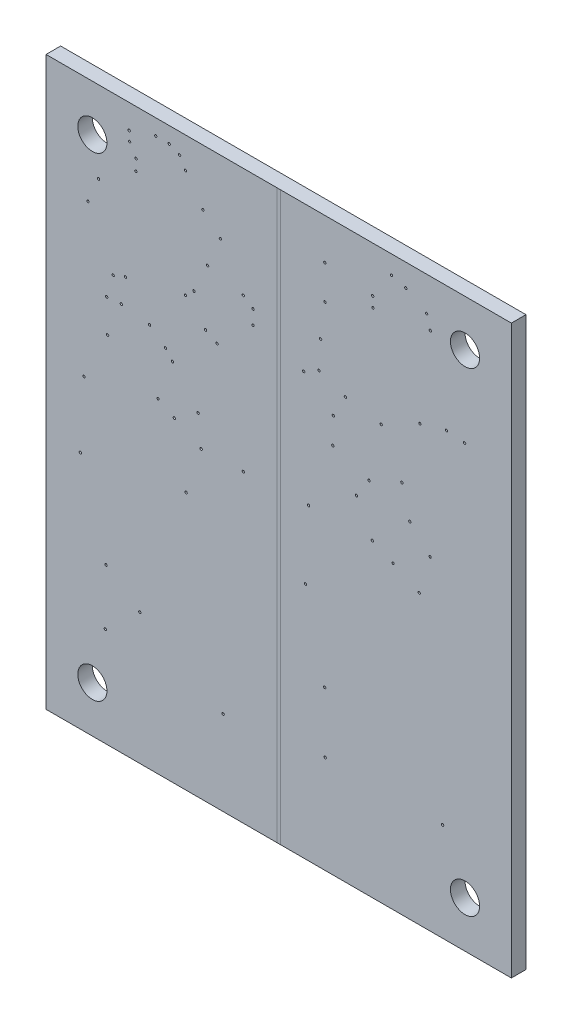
ISO-10303-21;
HEADER;
FILE_DESCRIPTION(('STEP AP214'),'2;1');
FILE_NAME('part.step','',(''),(''),'','','');
FILE_SCHEMA(('AUTOMOTIVE_DESIGN { 1 0 10303 214 1 1 1 1 }'));
ENDSEC;
DATA;
#1=APPLICATION_CONTEXT('core data for automotive mechanical design processes');
#2=APPLICATION_PROTOCOL_DEFINITION('international standard','automotive_design',2000,#1);
#3=PRODUCT_CONTEXT('',#1,'mechanical');
#4=PRODUCT('Part','Part','',(#3));
#5=PRODUCT_RELATED_PRODUCT_CATEGORY('part','',(#4));
#6=PRODUCT_DEFINITION_FORMATION('','',#4);
#7=PRODUCT_DEFINITION_CONTEXT('part definition',#1,'design');
#8=PRODUCT_DEFINITION('design','',#6,#7);
#9=PRODUCT_DEFINITION_SHAPE('','',#8);
#10=(LENGTH_UNIT() NAMED_UNIT(*) SI_UNIT(.MILLI.,.METRE.));
#11=(NAMED_UNIT(*) PLANE_ANGLE_UNIT() SI_UNIT($,.RADIAN.));
#12=(NAMED_UNIT(*) SI_UNIT($,.STERADIAN.) SOLID_ANGLE_UNIT());
#13=UNCERTAINTY_MEASURE_WITH_UNIT(LENGTH_MEASURE(1.E-05),#10,'distance_accuracy_value','');
#14=(GEOMETRIC_REPRESENTATION_CONTEXT(3) GLOBAL_UNCERTAINTY_ASSIGNED_CONTEXT((#13)) GLOBAL_UNIT_ASSIGNED_CONTEXT((#10,
#11,#12)) REPRESENTATION_CONTEXT('',''));
#15=CARTESIAN_POINT('',(0.,0.,0.));
#16=DIRECTION('',(0.,0.,1.));
#17=DIRECTION('',(1.,0.,0.));
#18=AXIS2_PLACEMENT_3D('',#15,#16,#17);
#19=CARTESIAN_POINT('',(0.,0.,1.6));
#20=DIRECTION('',(0.,0.,1.));
#21=DIRECTION('',(1.,0.,0.));
#22=AXIS2_PLACEMENT_3D('',#19,#20,#21);
#23=PLANE('',#22);
#24=CARTESIAN_POINT('',(45.97,57.15,1.6));
#25=DIRECTION('',(0.,0.,1.));
#26=DIRECTION('',(1.,0.,0.));
#27=AXIS2_PLACEMENT_3D('',#24,#25,#26);
#28=CIRCLE('',#27,1.6);
#29=CARTESIAN_POINT('',(47.57,57.15,1.6));
#30=VERTEX_POINT('',#29);
#31=EDGE_CURVE('E579',#30,#30,#28,.T.);
#32=ORIENTED_EDGE('',*,*,#31,.F.);
#33=EDGE_LOOP('',(#32));
#34=FACE_BOUND('',#33,.T.);
#35=CARTESIAN_POINT('',(45.97,5.08,1.6));
#36=DIRECTION('',(0.,0.,1.));
#37=DIRECTION('',(1.,0.,0.));
#38=AXIS2_PLACEMENT_3D('',#35,#36,#37);
#39=CIRCLE('',#38,1.6);
#40=CARTESIAN_POINT('',(47.57,5.08,1.6));
#41=VERTEX_POINT('',#40);
#42=EDGE_CURVE('E567',#41,#41,#39,.T.);
#43=ORIENTED_EDGE('',*,*,#42,.F.);
#44=EDGE_LOOP('',(#43));
#45=FACE_BOUND('',#44,.T.);
#46=CARTESIAN_POINT('',(41.7576,58.4708,1.6));
#47=DIRECTION('',(0.,0.,1.));
#48=DIRECTION('',(1.,0.,0.));
#49=AXIS2_PLACEMENT_3D('',#46,#47,#48);
#50=CIRCLE('',#49,0.127000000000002);
#51=CARTESIAN_POINT('',(41.8846,58.4708,1.6));
#52=VERTEX_POINT('',#51);
#53=EDGE_CURVE('E399',#52,#52,#50,.T.);
#54=ORIENTED_EDGE('',*,*,#53,.F.);
#55=EDGE_LOOP('',(#54));
#56=FACE_BOUND('',#55,.T.);
#57=CARTESIAN_POINT('',(45.9232,48.26,1.6));
#58=DIRECTION('',(0.,0.,1.));
#59=DIRECTION('',(1.,0.,0.));
#60=AXIS2_PLACEMENT_3D('',#57,#58,#59);
#61=CIRCLE('',#60,0.127000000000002);
#62=CARTESIAN_POINT('',(46.0502,48.26,1.6));
#63=VERTEX_POINT('',#62);
#64=EDGE_CURVE('E388',#63,#63,#61,.T.);
#65=ORIENTED_EDGE('',*,*,#64,.F.);
#66=EDGE_LOOP('',(#65));
#67=FACE_BOUND('',#66,.T.);
#68=CARTESIAN_POINT('',(42.164,57.0738,1.6));
#69=DIRECTION('',(0.,0.,1.));
#70=DIRECTION('',(1.,0.,0.));
#71=AXIS2_PLACEMENT_3D('',#68,#69,#70);
#72=CIRCLE('',#71,0.127000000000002);
#73=CARTESIAN_POINT('',(42.291,57.0738,1.6));
#74=VERTEX_POINT('',#73);
#75=EDGE_CURVE('E387',#74,#74,#72,.T.);
#76=ORIENTED_EDGE('',*,*,#75,.F.);
#77=EDGE_LOOP('',(#76));
#78=FACE_BOUND('',#77,.T.);
#79=CARTESIAN_POINT('',(37.8968,60.198,1.6));
#80=DIRECTION('',(0.,0.,1.));
#81=DIRECTION('',(1.,0.,0.));
#82=AXIS2_PLACEMENT_3D('',#79,#80,#81);
#83=CIRCLE('',#82,0.127000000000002);
#84=CARTESIAN_POINT('',(38.0238,60.198,1.6));
#85=VERTEX_POINT('',#84);
#86=EDGE_CURVE('E423',#85,#85,#83,.T.);
#87=ORIENTED_EDGE('',*,*,#86,.F.);
#88=EDGE_LOOP('',(#87));
#89=FACE_BOUND('',#88,.T.);
#90=CARTESIAN_POINT('',(41.021,47.6504,1.6));
#91=DIRECTION('',(0.,0.,1.));
#92=DIRECTION('',(1.,0.,0.));
#93=AXIS2_PLACEMENT_3D('',#90,#91,#92);
#94=CIRCLE('',#93,0.127000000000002);
#95=CARTESIAN_POINT('',(41.148,47.6504,1.6));
#96=VERTEX_POINT('',#95);
#97=EDGE_CURVE('E412',#96,#96,#94,.T.);
#98=ORIENTED_EDGE('',*,*,#97,.F.);
#99=EDGE_LOOP('',(#98));
#100=FACE_BOUND('',#99,.T.);
#101=CARTESIAN_POINT('',(39.4716,59.7662,1.6));
#102=DIRECTION('',(0.,0.,1.));
#103=DIRECTION('',(1.,0.,0.));
#104=AXIS2_PLACEMENT_3D('',#101,#102,#103);
#105=CIRCLE('',#104,0.127000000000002);
#106=CARTESIAN_POINT('',(39.5986,59.7662,1.6));
#107=VERTEX_POINT('',#106);
#108=EDGE_CURVE('E411',#107,#107,#105,.T.);
#109=ORIENTED_EDGE('',*,*,#108,.F.);
#110=EDGE_LOOP('',(#109));
#111=FACE_BOUND('',#110,.T.);
#112=CARTESIAN_POINT('',(43.942,48.4632,1.6));
#113=DIRECTION('',(0.,0.,1.));
#114=DIRECTION('',(1.,0.,0.));
#115=AXIS2_PLACEMENT_3D('',#112,#113,#114);
#116=CIRCLE('',#115,0.127000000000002);
#117=CARTESIAN_POINT('',(44.069,48.4632,1.6));
#118=VERTEX_POINT('',#117);
#119=EDGE_CURVE('E400',#118,#118,#116,.T.);
#120=ORIENTED_EDGE('',*,*,#119,.F.);
#121=EDGE_LOOP('',(#120));
#122=FACE_BOUND('',#121,.T.);
#123=CARTESIAN_POINT('',(31.4706,40.7924,1.6));
#124=DIRECTION('',(0.,0.,1.));
#125=DIRECTION('',(1.,0.,0.));
#126=AXIS2_PLACEMENT_3D('',#123,#124,#125);
#127=CIRCLE('',#126,0.127000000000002);
#128=CARTESIAN_POINT('',(31.5976,40.7924,1.6));
#129=VERTEX_POINT('',#128);
#130=EDGE_CURVE('E495',#129,#129,#127,.T.);
#131=ORIENTED_EDGE('',*,*,#130,.F.);
#132=EDGE_LOOP('',(#131));
#133=FACE_BOUND('',#132,.T.);
#134=CARTESIAN_POINT('',(30.5816,17.3736,1.6));
#135=DIRECTION('',(0.,0.,1.));
#136=DIRECTION('',(1.,0.,0.));
#137=AXIS2_PLACEMENT_3D('',#134,#135,#136);
#138=CIRCLE('',#137,0.126999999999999);
#139=CARTESIAN_POINT('',(30.7086,17.3736,1.6));
#140=VERTEX_POINT('',#139);
#141=EDGE_CURVE('E484',#140,#140,#138,.T.);
#142=ORIENTED_EDGE('',*,*,#141,.F.);
#143=EDGE_LOOP('',(#142));
#144=FACE_BOUND('',#143,.T.);
#145=CARTESIAN_POINT('',(28.8036,33.782,1.6));
#146=DIRECTION('',(0.,0.,1.));
#147=DIRECTION('',(1.,0.,0.));
#148=AXIS2_PLACEMENT_3D('',#145,#146,#147);
#149=CIRCLE('',#148,0.126999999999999);
#150=CARTESIAN_POINT('',(28.9306,33.782,1.6));
#151=VERTEX_POINT('',#150);
#152=EDGE_CURVE('E483',#151,#151,#149,.T.);
#153=ORIENTED_EDGE('',*,*,#152,.F.);
#154=EDGE_LOOP('',(#153));
#155=FACE_BOUND('',#154,.T.);
#156=CARTESIAN_POINT('',(35.8394,57.2008,1.6));
#157=DIRECTION('',(0.,0.,1.));
#158=DIRECTION('',(1.,0.,0.));
#159=AXIS2_PLACEMENT_3D('',#156,#157,#158);
#160=CIRCLE('',#159,0.127000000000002);
#161=CARTESIAN_POINT('',(35.9664,57.2008,1.6));
#162=VERTEX_POINT('',#161);
#163=EDGE_CURVE('E472',#162,#162,#160,.T.);
#164=ORIENTED_EDGE('',*,*,#163,.F.);
#165=EDGE_LOOP('',(#164));
#166=FACE_BOUND('',#165,.T.);
#167=CARTESIAN_POINT('',(39.9034,37.7952,1.6));
#168=DIRECTION('',(0.,0.,1.));
#169=DIRECTION('',(1.,0.,0.));
#170=AXIS2_PLACEMENT_3D('',#167,#168,#169);
#171=CIRCLE('',#170,0.127000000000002);
#172=CARTESIAN_POINT('',(40.0304,37.7952,1.6));
#173=VERTEX_POINT('',#172);
#174=EDGE_CURVE('E496',#173,#173,#171,.T.);
#175=ORIENTED_EDGE('',*,*,#174,.F.);
#176=EDGE_LOOP('',(#175));
#177=FACE_BOUND('',#176,.T.);
#178=CARTESIAN_POINT('',(28.2702,46.2534,1.6));
#179=DIRECTION('',(0.,0.,1.));
#180=DIRECTION('',(1.,0.,0.));
#181=AXIS2_PLACEMENT_3D('',#178,#179,#180);
#182=CIRCLE('',#181,0.126999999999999);
#183=CARTESIAN_POINT('',(28.3972,46.2534,1.6));
#184=VERTEX_POINT('',#183);
#185=EDGE_CURVE('E447',#184,#184,#182,.T.);
#186=ORIENTED_EDGE('',*,*,#185,.F.);
#187=EDGE_LOOP('',(#186));
#188=FACE_BOUND('',#187,.T.);
#189=CARTESIAN_POINT('',(40.9448,31.5468,1.6));
#190=DIRECTION('',(0.,0.,1.));
#191=DIRECTION('',(1.,0.,0.));
#192=AXIS2_PLACEMENT_3D('',#189,#190,#191);
#193=CIRCLE('',#192,0.127000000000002);
#194=CARTESIAN_POINT('',(41.0718,31.5468,1.6));
#195=VERTEX_POINT('',#194);
#196=EDGE_CURVE('E436',#195,#195,#193,.T.);
#197=ORIENTED_EDGE('',*,*,#196,.F.);
#198=EDGE_LOOP('',(#197));
#199=FACE_BOUND('',#198,.T.);
#200=CARTESIAN_POINT('',(30.1244,50.2412,1.6));
#201=DIRECTION('',(0.,0.,1.));
#202=DIRECTION('',(1.,0.,0.));
#203=AXIS2_PLACEMENT_3D('',#200,#201,#202);
#204=CIRCLE('',#203,0.126999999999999);
#205=CARTESIAN_POINT('',(30.2514,50.2412,1.6));
#206=VERTEX_POINT('',#205);
#207=EDGE_CURVE('E435',#206,#206,#204,.T.);
#208=ORIENTED_EDGE('',*,*,#207,.F.);
#209=EDGE_LOOP('',(#208));
#210=FACE_BOUND('',#209,.T.);
#211=CARTESIAN_POINT('',(39.0398,41.0718,1.6));
#212=DIRECTION('',(0.,0.,1.));
#213=DIRECTION('',(1.,0.,0.));
#214=AXIS2_PLACEMENT_3D('',#211,#212,#213);
#215=CIRCLE('',#214,0.127000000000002);
#216=CARTESIAN_POINT('',(39.1668,41.0718,1.6));
#217=VERTEX_POINT('',#216);
#218=EDGE_CURVE('E424',#217,#217,#215,.T.);
#219=ORIENTED_EDGE('',*,*,#218,.F.);
#220=EDGE_LOOP('',(#219));
#221=FACE_BOUND('',#220,.T.);
#222=CARTESIAN_POINT('',(30.5816,57.7342,1.6));
#223=DIRECTION('',(0.,0.,1.));
#224=DIRECTION('',(1.,0.,0.));
#225=AXIS2_PLACEMENT_3D('',#222,#223,#224);
#226=CIRCLE('',#225,0.126999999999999);
#227=CARTESIAN_POINT('',(30.7086,57.7342,1.6));
#228=VERTEX_POINT('',#227);
#229=EDGE_CURVE('E471',#228,#228,#226,.T.);
#230=ORIENTED_EDGE('',*,*,#229,.F.);
#231=EDGE_LOOP('',(#230));
#232=FACE_BOUND('',#231,.T.);
#233=CARTESIAN_POINT('',(35.7886,33.9344,1.6));
#234=DIRECTION('',(0.,0.,1.));
#235=DIRECTION('',(1.,0.,0.));
#236=AXIS2_PLACEMENT_3D('',#233,#234,#235);
#237=CIRCLE('',#236,0.127000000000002);
#238=CARTESIAN_POINT('',(35.9156,33.9344,1.6));
#239=VERTEX_POINT('',#238);
#240=EDGE_CURVE('E460',#239,#239,#237,.T.);
#241=ORIENTED_EDGE('',*,*,#240,.F.);
#242=EDGE_LOOP('',(#241));
#243=FACE_BOUND('',#242,.T.);
#244=CARTESIAN_POINT('',(29.9466,47.1678,1.6));
#245=DIRECTION('',(0.,0.,1.));
#246=DIRECTION('',(1.,0.,0.));
#247=AXIS2_PLACEMENT_3D('',#244,#245,#246);
#248=CIRCLE('',#247,0.126999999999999);
#249=CARTESIAN_POINT('',(30.0736,47.1678,1.6));
#250=VERTEX_POINT('',#249);
#251=EDGE_CURVE('E459',#250,#250,#248,.T.);
#252=ORIENTED_EDGE('',*,*,#251,.F.);
#253=EDGE_LOOP('',(#252));
#254=FACE_BOUND('',#253,.T.);
#255=CARTESIAN_POINT('',(38.0746,32.9184,1.6));
#256=DIRECTION('',(0.,0.,1.));
#257=DIRECTION('',(1.,0.,0.));
#258=AXIS2_PLACEMENT_3D('',#255,#256,#257);
#259=CIRCLE('',#258,0.127000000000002);
#260=CARTESIAN_POINT('',(38.2016,32.9184,1.6));
#261=VERTEX_POINT('',#260);
#262=EDGE_CURVE('E448',#261,#261,#259,.T.);
#263=ORIENTED_EDGE('',*,*,#262,.F.);
#264=EDGE_LOOP('',(#263));
#265=FACE_BOUND('',#264,.T.);
#266=CARTESIAN_POINT('',(42.1386,35.56,1.6));
#267=DIRECTION('',(0.,0.,1.));
#268=DIRECTION('',(1.,0.,0.));
#269=AXIS2_PLACEMENT_3D('',#266,#267,#268);
#270=CIRCLE('',#269,0.127000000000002);
#271=CARTESIAN_POINT('',(42.2656,35.56,1.6));
#272=VERTEX_POINT('',#271);
#273=EDGE_CURVE('E220',#272,#272,#270,.T.);
#274=ORIENTED_EDGE('',*,*,#273,.F.);
#275=EDGE_LOOP('',(#274));
#276=FACE_BOUND('',#275,.T.);
#277=CARTESIAN_POINT('',(36.7792,45.466,1.6));
#278=DIRECTION('',(0.,0.,1.));
#279=DIRECTION('',(1.,0.,0.));
#280=AXIS2_PLACEMENT_3D('',#277,#278,#279);
#281=CIRCLE('',#280,0.127000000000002);
#282=CARTESIAN_POINT('',(36.9062,45.466,1.6));
#283=VERTEX_POINT('',#282);
#284=EDGE_CURVE('E226',#283,#283,#281,.T.);
#285=ORIENTED_EDGE('',*,*,#284,.F.);
#286=EDGE_LOOP('',(#285));
#287=FACE_BOUND('',#286,.T.);
#288=CARTESIAN_POINT('',(35.433,39.4716,1.6));
#289=DIRECTION('',(0.,0.,1.));
#290=DIRECTION('',(1.,0.,0.));
#291=AXIS2_PLACEMENT_3D('',#288,#289,#290);
#292=CIRCLE('',#291,0.127000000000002);
#293=CARTESIAN_POINT('',(35.56,39.4716,1.6));
#294=VERTEX_POINT('',#293);
#295=EDGE_CURVE('E232',#294,#294,#292,.T.);
#296=ORIENTED_EDGE('',*,*,#295,.F.);
#297=EDGE_LOOP('',(#296));
#298=FACE_BOUND('',#297,.T.);
#299=CARTESIAN_POINT('',(31.5214,43.6626,1.6));
#300=DIRECTION('',(0.,0.,1.));
#301=DIRECTION('',(1.,0.,0.));
#302=AXIS2_PLACEMENT_3D('',#299,#300,#301);
#303=CIRCLE('',#302,0.127000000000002);
#304=CARTESIAN_POINT('',(31.6484,43.6626,1.6));
#305=VERTEX_POINT('',#304);
#306=EDGE_CURVE('E198',#305,#305,#303,.T.);
#307=ORIENTED_EDGE('',*,*,#306,.F.);
#308=EDGE_LOOP('',(#307));
#309=FACE_BOUND('',#308,.T.);
#310=CARTESIAN_POINT('',(43.5102,10.7696,1.6));
#311=DIRECTION('',(0.,0.,1.));
#312=DIRECTION('',(1.,0.,0.));
#313=AXIS2_PLACEMENT_3D('',#310,#311,#312);
#314=CIRCLE('',#313,0.127000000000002);
#315=CARTESIAN_POINT('',(43.6372,10.7696,1.6));
#316=VERTEX_POINT('',#315);
#317=EDGE_CURVE('E197',#316,#316,#314,.T.);
#318=ORIENTED_EDGE('',*,*,#317,.F.);
#319=EDGE_LOOP('',(#318));
#320=FACE_BOUND('',#319,.T.);
#321=CARTESIAN_POINT('',(30.6324,10.7442,1.6));
#322=DIRECTION('',(0.,0.,1.));
#323=DIRECTION('',(1.,0.,0.));
#324=AXIS2_PLACEMENT_3D('',#321,#322,#323);
#325=CIRCLE('',#324,0.126999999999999);
#326=CARTESIAN_POINT('',(30.7594,10.7442,1.6));
#327=VERTEX_POINT('',#326);
#328=EDGE_CURVE('E204',#327,#327,#325,.T.);
#329=ORIENTED_EDGE('',*,*,#328,.F.);
#330=EDGE_LOOP('',(#329));
#331=FACE_BOUND('',#330,.T.);
#332=CARTESIAN_POINT('',(28.4734,26.1366,1.6));
#333=DIRECTION('',(0.,0.,1.));
#334=DIRECTION('',(1.,0.,0.));
#335=AXIS2_PLACEMENT_3D('',#332,#333,#334);
#336=CIRCLE('',#335,0.126999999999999);
#337=CARTESIAN_POINT('',(28.6004,26.1366,1.6));
#338=VERTEX_POINT('',#337);
#339=EDGE_CURVE('E210',#338,#338,#336,.T.);
#340=ORIENTED_EDGE('',*,*,#339,.F.);
#341=EDGE_LOOP('',(#340));
#342=FACE_BOUND('',#341,.T.);
#343=CARTESIAN_POINT('',(35.8648,56.0832,1.6));
#344=DIRECTION('',(0.,0.,1.));
#345=DIRECTION('',(1.,0.,0.));
#346=AXIS2_PLACEMENT_3D('',#343,#344,#345);
#347=CIRCLE('',#346,0.127000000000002);
#348=CARTESIAN_POINT('',(35.9918,56.0832,1.6));
#349=VERTEX_POINT('',#348);
#350=EDGE_CURVE('E141',#349,#349,#347,.T.);
#351=ORIENTED_EDGE('',*,*,#350,.F.);
#352=EDGE_LOOP('',(#351));
#353=FACE_BOUND('',#352,.T.);
#354=CARTESIAN_POINT('',(34.0614,37.338,1.6));
#355=DIRECTION('',(0.,0.,1.));
#356=DIRECTION('',(1.,0.,0.));
#357=AXIS2_PLACEMENT_3D('',#354,#355,#356);
#358=CIRCLE('',#357,0.127000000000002);
#359=CARTESIAN_POINT('',(34.1884,37.338,1.6));
#360=VERTEX_POINT('',#359);
#361=EDGE_CURVE('E268',#360,#360,#358,.T.);
#362=ORIENTED_EDGE('',*,*,#361,.F.);
#363=EDGE_LOOP('',(#362));
#364=FACE_BOUND('',#363,.T.);
#365=CARTESIAN_POINT('',(32.8422,46.101,1.6));
#366=DIRECTION('',(0.,0.,1.));
#367=DIRECTION('',(1.,0.,0.));
#368=AXIS2_PLACEMENT_3D('',#365,#366,#367);
#369=CIRCLE('',#368,0.127000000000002);
#370=CARTESIAN_POINT('',(32.9692,46.101,1.6));
#371=VERTEX_POINT('',#370);
#372=EDGE_CURVE('E267',#371,#371,#369,.T.);
#373=ORIENTED_EDGE('',*,*,#372,.F.);
#374=EDGE_LOOP('',(#373));
#375=FACE_BOUND('',#374,.T.);
#376=CARTESIAN_POINT('',(30.607,54.0004,1.6));
#377=DIRECTION('',(0.,0.,1.));
#378=DIRECTION('',(1.,0.,0.));
#379=AXIS2_PLACEMENT_3D('',#376,#377,#378);
#380=CIRCLE('',#379,0.126999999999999);
#381=CARTESIAN_POINT('',(30.734,54.0004,1.6));
#382=VERTEX_POINT('',#381);
#383=EDGE_CURVE('E133',#382,#382,#380,.T.);
#384=ORIENTED_EDGE('',*,*,#383,.F.);
#385=EDGE_LOOP('',(#384));
#386=FACE_BOUND('',#385,.T.);
#387=DIRECTION('',(-1.,0.,0.));
#388=VECTOR('',#387,1.);
#389=CARTESIAN_POINT('',(51.054,62.23,1.6));
#390=LINE('',#389,#388);
#391=CARTESIAN_POINT('',(51.054,62.23,1.6));
#392=VERTEX_POINT('',#391);
#393=CARTESIAN_POINT('',(25.7302,62.23,1.6));
#394=VERTEX_POINT('',#393);
#395=EDGE_CURVE('E126',#392,#394,#390,.T.);
#396=ORIENTED_EDGE('',*,*,#395,.T.);
#397=DIRECTION('',(0.,-1.,0.));
#398=VECTOR('',#397,1.);
#399=CARTESIAN_POINT('',(25.7302,0.,1.6));
#400=LINE('',#399,#398);
#401=CARTESIAN_POINT('',(25.7302,0.,1.6));
#402=VERTEX_POINT('',#401);
#403=EDGE_CURVE('E11',#394,#402,#400,.T.);
#404=ORIENTED_EDGE('',*,*,#403,.T.);
#405=DIRECTION('',(1.,0.,0.));
#406=VECTOR('',#405,1.);
#407=CARTESIAN_POINT('',(0.,0.,1.6));
#408=LINE('',#407,#406);
#409=CARTESIAN_POINT('',(51.054,0.,1.6));
#410=VERTEX_POINT('',#409);
#411=EDGE_CURVE('E103',#402,#410,#408,.T.);
#412=ORIENTED_EDGE('',*,*,#411,.T.);
#413=DIRECTION('',(0.,1.,0.));
#414=VECTOR('',#413,1.);
#415=CARTESIAN_POINT('',(51.054,0.,1.6));
#416=LINE('',#415,#414);
#417=EDGE_CURVE('E101',#410,#392,#416,.T.);
#418=ORIENTED_EDGE('',*,*,#417,.T.);
#419=EDGE_LOOP('',(#396,#404,#412,#418));
#420=FACE_BOUND('',#419,.T.);
#421=ADVANCED_FACE('F41',(#34,#45,#56,#67,#78,#89,#100,#111,#122,#133,#144,#155,#166,#177,#188,
#199,#210,#221,#232,#243,#254,#265,#276,#287,#298,#309,#320,#331,#342,#353,#364,#375,#386,#420),
#23,.T.);
#422=CARTESIAN_POINT('',(6.5786,17.018,1.6));
#423=DIRECTION('',(0.,0.,1.));
#424=DIRECTION('',(1.,0.,0.));
#425=AXIS2_PLACEMENT_3D('',#422,#423,#424);
#426=CIRCLE('',#425,0.127);
#427=CARTESIAN_POINT('',(6.7056,17.018,1.6));
#428=VERTEX_POINT('',#427);
#429=EDGE_CURVE('E508',#428,#428,#426,.T.);
#430=ORIENTED_EDGE('',*,*,#429,.F.);
#431=EDGE_LOOP('',(#430));
#432=FACE_BOUND('',#431,.T.);
#433=CARTESIAN_POINT('',(6.6548,42.5196,1.6));
#434=DIRECTION('',(0.,0.,1.));
#435=DIRECTION('',(1.,0.,0.));
#436=AXIS2_PLACEMENT_3D('',#433,#434,#435);
#437=CIRCLE('',#436,0.127);
#438=CARTESIAN_POINT('',(6.7818,42.5196,1.6));
#439=VERTEX_POINT('',#438);
#440=EDGE_CURVE('E544',#439,#439,#437,.T.);
#441=ORIENTED_EDGE('',*,*,#440,.F.);
#442=EDGE_LOOP('',(#441));
#443=FACE_BOUND('',#442,.T.);
#444=CARTESIAN_POINT('',(16.6878,36.4998,1.6));
#445=DIRECTION('',(0.,0.,1.));
#446=DIRECTION('',(1.,0.,0.));
#447=AXIS2_PLACEMENT_3D('',#444,#445,#446);
#448=CIRCLE('',#447,0.126999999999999);
#449=CARTESIAN_POINT('',(16.8148,36.4998,1.6));
#450=VERTEX_POINT('',#449);
#451=EDGE_CURVE('E538',#450,#450,#448,.T.);
#452=ORIENTED_EDGE('',*,*,#451,.F.);
#453=EDGE_LOOP('',(#452));
#454=FACE_BOUND('',#453,.T.);
#455=CARTESIAN_POINT('',(7.366,44.9326,1.6));
#456=DIRECTION('',(0.,0.,1.));
#457=DIRECTION('',(1.,0.,0.));
#458=AXIS2_PLACEMENT_3D('',#455,#456,#457);
#459=CIRCLE('',#458,0.127);
#460=CARTESIAN_POINT('',(7.493,44.9326,1.6));
#461=VERTEX_POINT('',#460);
#462=EDGE_CURVE('E531',#461,#461,#459,.T.);
#463=ORIENTED_EDGE('',*,*,#462,.F.);
#464=EDGE_LOOP('',(#463));
#465=FACE_BOUND('',#464,.T.);
#466=CARTESIAN_POINT('',(17.2085,56.0705,1.6));
#467=DIRECTION('',(0.,0.,1.));
#468=DIRECTION('',(1.,0.,0.));
#469=AXIS2_PLACEMENT_3D('',#466,#467,#468);
#470=CIRCLE('',#469,0.126999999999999);
#471=CARTESIAN_POINT('',(17.3355,56.0705,1.6));
#472=VERTEX_POINT('',#471);
#473=EDGE_CURVE('E532',#472,#472,#470,.T.);
#474=ORIENTED_EDGE('',*,*,#473,.F.);
#475=EDGE_LOOP('',(#474));
#476=FACE_BOUND('',#475,.T.);
#477=CARTESIAN_POINT('',(10.287,14.3764,1.6));
#478=DIRECTION('',(0.,0.,1.));
#479=DIRECTION('',(1.,0.,0.));
#480=AXIS2_PLACEMENT_3D('',#477,#478,#479);
#481=CIRCLE('',#480,0.127);
#482=CARTESIAN_POINT('',(10.414,14.3764,1.6));
#483=VERTEX_POINT('',#482);
#484=EDGE_CURVE('E555',#483,#483,#481,.T.);
#485=ORIENTED_EDGE('',*,*,#484,.F.);
#486=EDGE_LOOP('',(#485));
#487=FACE_BOUND('',#486,.T.);
#488=CARTESIAN_POINT('',(19.431,9.271,1.6));
#489=DIRECTION('',(0.,0.,1.));
#490=DIRECTION('',(1.,0.,0.));
#491=AXIS2_PLACEMENT_3D('',#488,#489,#490);
#492=CIRCLE('',#491,0.126999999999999);
#493=CARTESIAN_POINT('',(19.558,9.271,1.6));
#494=VERTEX_POINT('',#493);
#495=EDGE_CURVE('E256',#494,#494,#492,.T.);
#496=ORIENTED_EDGE('',*,*,#495,.F.);
#497=EDGE_LOOP('',(#496));
#498=FACE_BOUND('',#497,.T.);
#499=CARTESIAN_POINT('',(15.2908,58.8518,1.6));
#500=DIRECTION('',(0.,0.,1.));
#501=DIRECTION('',(1.,0.,0.));
#502=AXIS2_PLACEMENT_3D('',#499,#500,#501);
#503=CIRCLE('',#502,0.127);
#504=CARTESIAN_POINT('',(15.4178,58.8518,1.6));
#505=VERTEX_POINT('',#504);
#506=EDGE_CURVE('E279',#505,#505,#503,.T.);
#507=ORIENTED_EDGE('',*,*,#506,.F.);
#508=EDGE_LOOP('',(#507));
#509=FACE_BOUND('',#508,.T.);
#510=CARTESIAN_POINT('',(19.1262,54.2798,1.6));
#511=DIRECTION('',(0.,0.,1.));
#512=DIRECTION('',(1.,0.,0.));
#513=AXIS2_PLACEMENT_3D('',#510,#511,#512);
#514=CIRCLE('',#513,0.126999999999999);
#515=CARTESIAN_POINT('',(19.2532,54.2798,1.6));
#516=VERTEX_POINT('',#515);
#517=EDGE_CURVE('E174',#516,#516,#514,.T.);
#518=ORIENTED_EDGE('',*,*,#517,.F.);
#519=EDGE_LOOP('',(#518));
#520=FACE_BOUND('',#519,.T.);
#521=CARTESIAN_POINT('',(12.2936,35.6616,1.6));
#522=DIRECTION('',(0.,0.,1.));
#523=DIRECTION('',(1.,0.,0.));
#524=AXIS2_PLACEMENT_3D('',#521,#522,#523);
#525=CIRCLE('',#524,0.127);
#526=CARTESIAN_POINT('',(12.4206,35.6616,1.6));
#527=VERTEX_POINT('',#526);
#528=EDGE_CURVE('E243',#527,#527,#525,.T.);
#529=ORIENTED_EDGE('',*,*,#528,.F.);
#530=EDGE_LOOP('',(#529));
#531=FACE_BOUND('',#530,.T.);
#532=CARTESIAN_POINT('',(15.367,28.2956,1.6));
#533=DIRECTION('',(0.,0.,1.));
#534=DIRECTION('',(1.,0.,0.));
#535=AXIS2_PLACEMENT_3D('',#532,#533,#534);
#536=CIRCLE('',#535,0.127);
#537=CARTESIAN_POINT('',(15.494,28.2956,1.6));
#538=VERTEX_POINT('',#537);
#539=EDGE_CURVE('E244',#538,#538,#536,.T.);
#540=ORIENTED_EDGE('',*,*,#539,.F.);
#541=EDGE_LOOP('',(#540));
#542=FACE_BOUND('',#541,.T.);
#543=CARTESIAN_POINT('',(11.3538,42.2148,1.6));
#544=DIRECTION('',(0.,0.,1.));
#545=DIRECTION('',(1.,0.,0.));
#546=AXIS2_PLACEMENT_3D('',#543,#544,#545);
#547=CIRCLE('',#546,0.127);
#548=CARTESIAN_POINT('',(11.4808,42.2148,1.6));
#549=VERTEX_POINT('',#548);
#550=EDGE_CURVE('E255',#549,#549,#547,.T.);
#551=ORIENTED_EDGE('',*,*,#550,.F.);
#552=EDGE_LOOP('',(#551));
#553=FACE_BOUND('',#552,.T.);
#554=CARTESIAN_POINT('',(16.2306,47.8536,1.6));
#555=DIRECTION('',(0.,0.,1.));
#556=DIRECTION('',(1.,0.,0.));
#557=AXIS2_PLACEMENT_3D('',#554,#555,#556);
#558=CIRCLE('',#557,0.126999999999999);
#559=CARTESIAN_POINT('',(16.3576,47.8536,1.6));
#560=VERTEX_POINT('',#559);
#561=EDGE_CURVE('E304',#560,#560,#558,.T.);
#562=ORIENTED_EDGE('',*,*,#561,.F.);
#563=EDGE_LOOP('',(#562));
#564=FACE_BOUND('',#563,.T.);
#565=CARTESIAN_POINT('',(12.0396,60.5028,1.6));
#566=DIRECTION('',(0.,0.,1.));
#567=DIRECTION('',(1.,0.,0.));
#568=AXIS2_PLACEMENT_3D('',#565,#566,#567);
#569=CIRCLE('',#568,0.127);
#570=CARTESIAN_POINT('',(12.1666,60.5028,1.6));
#571=VERTEX_POINT('',#570);
#572=EDGE_CURVE('E315',#571,#571,#569,.T.);
#573=ORIENTED_EDGE('',*,*,#572,.F.);
#574=EDGE_LOOP('',(#573));
#575=FACE_BOUND('',#574,.T.);
#576=CARTESIAN_POINT('',(15.2908,46.99,1.6));
#577=DIRECTION('',(0.,0.,1.));
#578=DIRECTION('',(1.,0.,0.));
#579=AXIS2_PLACEMENT_3D('',#576,#577,#578);
#580=CIRCLE('',#579,0.127);
#581=CARTESIAN_POINT('',(15.4178,46.99,1.6));
#582=VERTEX_POINT('',#581);
#583=EDGE_CURVE('E316',#582,#582,#580,.T.);
#584=ORIENTED_EDGE('',*,*,#583,.F.);
#585=EDGE_LOOP('',(#584));
#586=FACE_BOUND('',#585,.T.);
#587=CARTESIAN_POINT('',(22.7076,49.403,1.6));
#588=DIRECTION('',(0.,0.,1.));
#589=DIRECTION('',(1.,0.,0.));
#590=AXIS2_PLACEMENT_3D('',#587,#588,#589);
#591=CIRCLE('',#590,0.126999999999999);
#592=CARTESIAN_POINT('',(22.8346,49.403,1.6));
#593=VERTEX_POINT('',#592);
#594=EDGE_CURVE('E327',#593,#593,#591,.T.);
#595=ORIENTED_EDGE('',*,*,#594,.F.);
#596=EDGE_LOOP('',(#595));
#597=FACE_BOUND('',#596,.T.);
#598=CARTESIAN_POINT('',(18.7706,44.1452,1.6));
#599=DIRECTION('',(0.,0.,1.));
#600=DIRECTION('',(1.,0.,0.));
#601=AXIS2_PLACEMENT_3D('',#598,#599,#600);
#602=CIRCLE('',#601,0.126999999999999);
#603=CARTESIAN_POINT('',(18.8976,44.1452,1.6));
#604=VERTEX_POINT('',#603);
#605=EDGE_CURVE('E280',#604,#604,#602,.T.);
#606=ORIENTED_EDGE('',*,*,#605,.F.);
#607=EDGE_LOOP('',(#606));
#608=FACE_BOUND('',#607,.T.);
#609=CARTESIAN_POINT('',(14.6558,59.9948,1.6));
#610=DIRECTION('',(0.,0.,1.));
#611=DIRECTION('',(1.,0.,0.));
#612=AXIS2_PLACEMENT_3D('',#609,#610,#611);
#613=CIRCLE('',#612,0.127);
#614=CARTESIAN_POINT('',(14.7828,59.9948,1.6));
#615=VERTEX_POINT('',#614);
#616=EDGE_CURVE('E291',#615,#615,#613,.T.);
#617=ORIENTED_EDGE('',*,*,#616,.F.);
#618=EDGE_LOOP('',(#617));
#619=FACE_BOUND('',#618,.T.);
#620=CARTESIAN_POINT('',(17.5006,44.8056,1.6));
#621=DIRECTION('',(0.,0.,1.));
#622=DIRECTION('',(1.,0.,0.));
#623=AXIS2_PLACEMENT_3D('',#620,#621,#622);
#624=CIRCLE('',#623,0.126999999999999);
#625=CARTESIAN_POINT('',(17.6276,44.8056,1.6));
#626=VERTEX_POINT('',#625);
#627=EDGE_CURVE('E292',#626,#626,#624,.T.);
#628=ORIENTED_EDGE('',*,*,#627,.F.);
#629=EDGE_LOOP('',(#628));
#630=FACE_BOUND('',#629,.T.);
#631=CARTESIAN_POINT('',(13.5128,60.4774,1.6));
#632=DIRECTION('',(0.,0.,1.));
#633=DIRECTION('',(1.,0.,0.));
#634=AXIS2_PLACEMENT_3D('',#631,#632,#633);
#635=CIRCLE('',#634,0.127);
#636=CARTESIAN_POINT('',(13.6398,60.4774,1.6));
#637=VERTEX_POINT('',#636);
#638=EDGE_CURVE('E303',#637,#637,#635,.T.);
#639=ORIENTED_EDGE('',*,*,#638,.F.);
#640=EDGE_LOOP('',(#639));
#641=FACE_BOUND('',#640,.T.);
#642=CARTESIAN_POINT('',(4.5974,50.5714,1.6));
#643=DIRECTION('',(0.,0.,1.));
#644=DIRECTION('',(1.,0.,0.));
#645=AXIS2_PLACEMENT_3D('',#642,#643,#644);
#646=CIRCLE('',#645,0.127);
#647=CARTESIAN_POINT('',(4.7244,50.5714,1.6));
#648=VERTEX_POINT('',#647);
#649=EDGE_CURVE('E166',#648,#648,#646,.T.);
#650=ORIENTED_EDGE('',*,*,#649,.F.);
#651=EDGE_LOOP('',(#650));
#652=FACE_BOUND('',#651,.T.);
#653=CARTESIAN_POINT('',(9.8552,56.0578,1.6));
#654=DIRECTION('',(0.,0.,1.));
#655=DIRECTION('',(1.,0.,0.));
#656=AXIS2_PLACEMENT_3D('',#653,#654,#655);
#657=CIRCLE('',#656,0.127);
#658=CARTESIAN_POINT('',(9.9822,56.0578,1.6));
#659=VERTEX_POINT('',#658);
#660=EDGE_CURVE('E160',#659,#659,#657,.T.);
#661=ORIENTED_EDGE('',*,*,#660,.F.);
#662=EDGE_LOOP('',(#661));
#663=FACE_BOUND('',#662,.T.);
#664=CARTESIAN_POINT('',(3.7592,26.289,1.6));
#665=DIRECTION('',(0.,0.,1.));
#666=DIRECTION('',(1.,0.,0.));
#667=AXIS2_PLACEMENT_3D('',#664,#665,#666);
#668=CIRCLE('',#667,0.127);
#669=CARTESIAN_POINT('',(3.8862,26.289,1.6));
#670=VERTEX_POINT('',#669);
#671=EDGE_CURVE('E154',#670,#670,#668,.T.);
#672=ORIENTED_EDGE('',*,*,#671,.F.);
#673=EDGE_LOOP('',(#672));
#674=FACE_BOUND('',#673,.T.);
#675=CARTESIAN_POINT('',(6.5024,10.8712,1.6));
#676=DIRECTION('',(0.,0.,1.));
#677=DIRECTION('',(1.,0.,0.));
#678=AXIS2_PLACEMENT_3D('',#675,#676,#677);
#679=CIRCLE('',#678,0.127);
#680=CARTESIAN_POINT('',(6.6294,10.8712,1.6));
#681=VERTEX_POINT('',#680);
#682=EDGE_CURVE('E147',#681,#681,#679,.T.);
#683=ORIENTED_EDGE('',*,*,#682,.F.);
#684=EDGE_LOOP('',(#683));
#685=FACE_BOUND('',#684,.T.);
#686=CARTESIAN_POINT('',(6.7564,38.9382,1.6));
#687=DIRECTION('',(0.,0.,1.));
#688=DIRECTION('',(1.,0.,0.));
#689=AXIS2_PLACEMENT_3D('',#686,#687,#688);
#690=CIRCLE('',#689,0.127);
#691=CARTESIAN_POINT('',(6.8834,38.9382,1.6));
#692=VERTEX_POINT('',#691);
#693=EDGE_CURVE('E148',#692,#692,#690,.T.);
#694=ORIENTED_EDGE('',*,*,#693,.F.);
#695=EDGE_LOOP('',(#694));
#696=FACE_BOUND('',#695,.T.);
#697=CARTESIAN_POINT('',(14.0716,34.7218,1.6));
#698=DIRECTION('',(0.,0.,1.));
#699=DIRECTION('',(1.,0.,0.));
#700=AXIS2_PLACEMENT_3D('',#697,#698,#699);
#701=CIRCLE('',#700,0.127);
#702=CARTESIAN_POINT('',(14.1986,34.7218,1.6));
#703=VERTEX_POINT('',#702);
#704=EDGE_CURVE('E186',#703,#703,#701,.T.);
#705=ORIENTED_EDGE('',*,*,#704,.F.);
#706=EDGE_LOOP('',(#705));
#707=FACE_BOUND('',#706,.T.);
#708=CARTESIAN_POINT('',(8.255,42.6466,1.6));
#709=DIRECTION('',(0.,0.,1.));
#710=DIRECTION('',(1.,0.,0.));
#711=AXIS2_PLACEMENT_3D('',#708,#709,#710);
#712=CIRCLE('',#711,0.127);
#713=CARTESIAN_POINT('',(8.382,42.6466,1.6));
#714=VERTEX_POINT('',#713);
#715=EDGE_CURVE('E180',#714,#714,#712,.T.);
#716=ORIENTED_EDGE('',*,*,#715,.F.);
#717=EDGE_LOOP('',(#716));
#718=FACE_BOUND('',#717,.T.);
#719=CARTESIAN_POINT('',(8.7122,45.4406,1.6));
#720=DIRECTION('',(0.,0.,1.));
#721=DIRECTION('',(1.,0.,0.));
#722=AXIS2_PLACEMENT_3D('',#719,#720,#721);
#723=CIRCLE('',#722,0.127);
#724=CARTESIAN_POINT('',(8.8392,45.4406,1.6));
#725=VERTEX_POINT('',#724);
#726=EDGE_CURVE('E173',#725,#725,#723,.T.);
#727=ORIENTED_EDGE('',*,*,#726,.F.);
#728=EDGE_LOOP('',(#727));
#729=FACE_BOUND('',#728,.T.);
#730=CARTESIAN_POINT('',(4.1656,33.7058,1.6));
#731=DIRECTION('',(0.,0.,1.));
#732=DIRECTION('',(1.,0.,0.));
#733=AXIS2_PLACEMENT_3D('',#730,#731,#732);
#734=CIRCLE('',#733,0.127);
#735=CARTESIAN_POINT('',(4.2926,33.7058,1.6));
#736=VERTEX_POINT('',#735);
#737=EDGE_CURVE('E507',#736,#736,#734,.T.);
#738=ORIENTED_EDGE('',*,*,#737,.F.);
#739=EDGE_LOOP('',(#738));
#740=FACE_BOUND('',#739,.T.);
#741=CARTESIAN_POINT('',(5.7658,53.2892,1.6));
#742=DIRECTION('',(0.,0.,1.));
#743=DIRECTION('',(1.,0.,0.));
#744=AXIS2_PLACEMENT_3D('',#741,#742,#743);
#745=CIRCLE('',#744,0.127);
#746=CARTESIAN_POINT('',(5.8928,53.2892,1.6));
#747=VERTEX_POINT('',#746);
#748=EDGE_CURVE('E514',#747,#747,#745,.T.);
#749=ORIENTED_EDGE('',*,*,#748,.F.);
#750=EDGE_LOOP('',(#749));
#751=FACE_BOUND('',#750,.T.);
#752=CARTESIAN_POINT('',(9.8806,57.277,1.6));
#753=DIRECTION('',(0.,0.,1.));
#754=DIRECTION('',(1.,0.,0.));
#755=AXIS2_PLACEMENT_3D('',#752,#753,#754);
#756=CIRCLE('',#755,0.127);
#757=CARTESIAN_POINT('',(10.0076,57.277,1.6));
#758=VERTEX_POINT('',#757);
#759=EDGE_CURVE('E520',#758,#758,#756,.T.);
#760=ORIENTED_EDGE('',*,*,#759,.F.);
#761=EDGE_LOOP('',(#760));
#762=FACE_BOUND('',#761,.T.);
#763=CARTESIAN_POINT('',(13.1064,40.894,1.6));
#764=DIRECTION('',(0.,0.,1.));
#765=DIRECTION('',(1.,0.,0.));
#766=AXIS2_PLACEMENT_3D('',#763,#764,#765);
#767=CIRCLE('',#766,0.127);
#768=CARTESIAN_POINT('',(13.2334,40.894,1.6));
#769=VERTEX_POINT('',#768);
#770=EDGE_CURVE('E352',#769,#769,#767,.T.);
#771=ORIENTED_EDGE('',*,*,#770,.F.);
#772=EDGE_LOOP('',(#771));
#773=FACE_BOUND('',#772,.T.);
#774=CARTESIAN_POINT('',(17.7292,51.0286,1.6));
#775=DIRECTION('',(0.,0.,1.));
#776=DIRECTION('',(1.,0.,0.));
#777=AXIS2_PLACEMENT_3D('',#774,#775,#776);
#778=CIRCLE('',#777,0.126999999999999);
#779=CARTESIAN_POINT('',(17.8562,51.0286,1.6));
#780=VERTEX_POINT('',#779);
#781=EDGE_CURVE('E363',#780,#780,#778,.T.);
#782=ORIENTED_EDGE('',*,*,#781,.F.);
#783=EDGE_LOOP('',(#782));
#784=FACE_BOUND('',#783,.T.);
#785=CARTESIAN_POINT('',(17.018,33.2486,1.6));
#786=DIRECTION('',(0.,0.,1.));
#787=DIRECTION('',(1.,0.,0.));
#788=AXIS2_PLACEMENT_3D('',#785,#786,#787);
#789=CIRCLE('',#788,0.126999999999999);
#790=CARTESIAN_POINT('',(17.145,33.2486,1.6));
#791=VERTEX_POINT('',#790);
#792=EDGE_CURVE('E364',#791,#791,#789,.T.);
#793=ORIENTED_EDGE('',*,*,#792,.F.);
#794=EDGE_LOOP('',(#793));
#795=FACE_BOUND('',#794,.T.);
#796=CARTESIAN_POINT('',(21.6408,50.165,1.6));
#797=DIRECTION('',(0.,0.,1.));
#798=DIRECTION('',(1.,0.,0.));
#799=AXIS2_PLACEMENT_3D('',#796,#797,#798);
#800=CIRCLE('',#799,0.126999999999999);
#801=CARTESIAN_POINT('',(21.7678,50.165,1.6));
#802=VERTEX_POINT('',#801);
#803=EDGE_CURVE('E375',#802,#802,#800,.T.);
#804=ORIENTED_EDGE('',*,*,#803,.F.);
#805=EDGE_LOOP('',(#804));
#806=FACE_BOUND('',#805,.T.);
#807=CARTESIAN_POINT('',(22.7076,47.8536,1.6));
#808=DIRECTION('',(0.,0.,1.));
#809=DIRECTION('',(1.,0.,0.));
#810=AXIS2_PLACEMENT_3D('',#807,#808,#809);
#811=CIRCLE('',#810,0.126999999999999);
#812=CARTESIAN_POINT('',(22.8346,47.8536,1.6));
#813=VERTEX_POINT('',#812);
#814=EDGE_CURVE('E328',#813,#813,#811,.T.);
#815=ORIENTED_EDGE('',*,*,#814,.F.);
#816=EDGE_LOOP('',(#815));
#817=FACE_BOUND('',#816,.T.);
#818=CARTESIAN_POINT('',(9.1186,59.563,1.6));
#819=DIRECTION('',(0.,0.,1.));
#820=DIRECTION('',(1.,0.,0.));
#821=AXIS2_PLACEMENT_3D('',#818,#819,#820);
#822=CIRCLE('',#821,0.127);
#823=CARTESIAN_POINT('',(9.2456,59.563,1.6));
#824=VERTEX_POINT('',#823);
#825=EDGE_CURVE('E339',#824,#824,#822,.T.);
#826=ORIENTED_EDGE('',*,*,#825,.F.);
#827=EDGE_LOOP('',(#826));
#828=FACE_BOUND('',#827,.T.);
#829=CARTESIAN_POINT('',(13.8684,39.9796,1.6));
#830=DIRECTION('',(0.,0.,1.));
#831=DIRECTION('',(1.,0.,0.));
#832=AXIS2_PLACEMENT_3D('',#829,#830,#831);
#833=CIRCLE('',#832,0.127);
#834=CARTESIAN_POINT('',(13.9954,39.9796,1.6));
#835=VERTEX_POINT('',#834);
#836=EDGE_CURVE('E340',#835,#835,#833,.T.);
#837=ORIENTED_EDGE('',*,*,#836,.F.);
#838=EDGE_LOOP('',(#837));
#839=FACE_BOUND('',#838,.T.);
#840=CARTESIAN_POINT('',(9.1694,58.5216,1.6));
#841=DIRECTION('',(0.,0.,1.));
#842=DIRECTION('',(1.,0.,0.));
#843=AXIS2_PLACEMENT_3D('',#840,#841,#842);
#844=CIRCLE('',#843,0.127);
#845=CARTESIAN_POINT('',(9.2964,58.5216,1.6));
#846=VERTEX_POINT('',#845);
#847=EDGE_CURVE('E351',#846,#846,#844,.T.);
#848=ORIENTED_EDGE('',*,*,#847,.F.);
#849=EDGE_LOOP('',(#848));
#850=FACE_BOUND('',#849,.T.);
#851=CARTESIAN_POINT('',(21.6408,33.401,1.6));
#852=DIRECTION('',(0.,0.,1.));
#853=DIRECTION('',(1.,0.,0.));
#854=AXIS2_PLACEMENT_3D('',#851,#852,#853);
#855=CIRCLE('',#854,0.126999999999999);
#856=CARTESIAN_POINT('',(21.7678,33.401,1.6));
#857=VERTEX_POINT('',#856);
#858=EDGE_CURVE('E376',#857,#857,#855,.T.);
#859=ORIENTED_EDGE('',*,*,#858,.F.);
#860=EDGE_LOOP('',(#859));
#861=FACE_BOUND('',#860,.T.);
#862=CARTESIAN_POINT('',(5.08,5.08,1.6));
#863=DIRECTION('',(0.,0.,1.));
#864=DIRECTION('',(1.,0.,0.));
#865=AXIS2_PLACEMENT_3D('',#862,#863,#864);
#866=CIRCLE('',#865,1.6);
#867=CARTESIAN_POINT('',(6.68,5.08,1.6));
#868=VERTEX_POINT('',#867);
#869=EDGE_CURVE('E556',#868,#868,#866,.T.);
#870=ORIENTED_EDGE('',*,*,#869,.F.);
#871=EDGE_LOOP('',(#870));
#872=FACE_BOUND('',#871,.T.);
#873=CARTESIAN_POINT('',(5.08,57.15,1.6));
#874=DIRECTION('',(0.,0.,1.));
#875=DIRECTION('',(1.,0.,0.));
#876=AXIS2_PLACEMENT_3D('',#873,#874,#875);
#877=CIRCLE('',#876,1.6);
#878=CARTESIAN_POINT('',(6.68,57.15,1.6));
#879=VERTEX_POINT('',#878);
#880=EDGE_CURVE('E573',#879,#879,#877,.T.);
#881=ORIENTED_EDGE('',*,*,#880,.F.);
#882=EDGE_LOOP('',(#881));
#883=FACE_BOUND('',#882,.T.);
#884=CARTESIAN_POINT('',(0.,0.,1.6));
#885=VERTEX_POINT('',#884);
#886=CARTESIAN_POINT('',(25.3238,0.,1.6));
#887=VERTEX_POINT('',#886);
#888=EDGE_CURVE('E93',#885,#887,#408,.T.);
#889=ORIENTED_EDGE('',*,*,#888,.T.);
#890=DIRECTION('',(0.,1.,0.));
#891=VECTOR('',#890,1.);
#892=CARTESIAN_POINT('',(25.3238,0.,1.6));
#893=LINE('',#892,#891);
#894=CARTESIAN_POINT('',(25.3238,62.23,1.6));
#895=VERTEX_POINT('',#894);
#896=EDGE_CURVE('E50',#887,#895,#893,.T.);
#897=ORIENTED_EDGE('',*,*,#896,.T.);
#898=CARTESIAN_POINT('',(0.,62.23,1.6));
#899=VERTEX_POINT('',#898);
#900=EDGE_CURVE('E107',#895,#899,#390,.T.);
#901=ORIENTED_EDGE('',*,*,#900,.T.);
#902=DIRECTION('',(0.,-1.,0.));
#903=VECTOR('',#902,1.);
#904=CARTESIAN_POINT('',(0.,62.23,1.6));
#905=LINE('',#904,#903);
#906=EDGE_CURVE('E105',#899,#885,#905,.T.);
#907=ORIENTED_EDGE('',*,*,#906,.T.);
#908=EDGE_LOOP('',(#889,#897,#901,#907));
#909=FACE_BOUND('',#908,.T.);
#910=ADVANCED_FACE('F106',(#432,#443,#454,#465,#476,#487,#498,#509,#520,#531,#542,#553,#564,
#575,#586,#597,#608,#619,#630,#641,#652,#663,#674,#685,#696,#707,#718,#729,#740,#751,#762,#773,
#784,#795,#806,#817,#828,#839,#850,#861,#872,#883,#909),#23,.T.);
#911=CARTESIAN_POINT('',(0.,62.23,1.6));
#912=DIRECTION('',(1.,0.,0.));
#913=DIRECTION('',(0.,0.,-1.));
#914=AXIS2_PLACEMENT_3D('',#911,#912,#913);
#915=PLANE('',#914);
#916=DIRECTION('',(0.,-1.,0.));
#917=VECTOR('',#916,1.);
#918=CARTESIAN_POINT('',(0.,62.23,0.));
#919=LINE('',#918,#917);
#920=CARTESIAN_POINT('',(0.,62.23,0.));
#921=VERTEX_POINT('',#920);
#922=CARTESIAN_POINT('',(0.,0.,0.));
#923=VERTEX_POINT('',#922);
#924=EDGE_CURVE('E114',#921,#923,#919,.T.);
#925=ORIENTED_EDGE('',*,*,#924,.T.);
#926=DIRECTION('',(0.,0.,-1.));
#927=VECTOR('',#926,1.);
#928=CARTESIAN_POINT('',(0.,0.,1.6));
#929=LINE('',#928,#927);
#930=EDGE_CURVE('E97',#885,#923,#929,.T.);
#931=ORIENTED_EDGE('',*,*,#930,.F.);
#932=ORIENTED_EDGE('',*,*,#906,.F.);
#933=DIRECTION('',(0.,0.,-1.));
#934=VECTOR('',#933,1.);
#935=CARTESIAN_POINT('',(0.,62.23,1.6));
#936=LINE('',#935,#934);
#937=EDGE_CURVE('E124',#899,#921,#936,.T.);
#938=ORIENTED_EDGE('',*,*,#937,.T.);
#939=EDGE_LOOP('',(#925,#931,#932,#938));
#940=FACE_BOUND('',#939,.T.);
#941=ADVANCED_FACE('F43',(#940),#915,.F.);
#942=CARTESIAN_POINT('',(0.,0.,1.6));
#943=DIRECTION('',(0.,1.,0.));
#944=DIRECTION('',(0.,0.,1.));
#945=AXIS2_PLACEMENT_3D('',#942,#943,#944);
#946=PLANE('',#945);
#947=DIRECTION('',(1.,0.,0.));
#948=VECTOR('',#947,1.);
#949=CARTESIAN_POINT('',(0.,0.,0.));
#950=LINE('',#949,#948);
#951=CARTESIAN_POINT('',(51.054,0.,0.));
#952=VERTEX_POINT('',#951);
#953=EDGE_CURVE('E130',#923,#952,#950,.T.);
#954=ORIENTED_EDGE('',*,*,#953,.T.);
#955=DIRECTION('',(0.,0.,-1.));
#956=VECTOR('',#955,1.);
#957=CARTESIAN_POINT('',(51.054,0.,1.6));
#958=LINE('',#957,#956);
#959=EDGE_CURVE('E115',#410,#952,#958,.T.);
#960=ORIENTED_EDGE('',*,*,#959,.F.);
#961=ORIENTED_EDGE('',*,*,#411,.F.);
#962=EDGE_CURVE('E100',#887,#402,#408,.T.);
#963=ORIENTED_EDGE('',*,*,#962,.F.);
#964=ORIENTED_EDGE('',*,*,#888,.F.);
#965=ORIENTED_EDGE('',*,*,#930,.T.);
#966=EDGE_LOOP('',(#954,#960,#961,#963,#964,#965));
#967=FACE_BOUND('',#966,.T.);
#968=ADVANCED_FACE('F95',(#967),#946,.F.);
#969=CARTESIAN_POINT('',(51.054,0.,1.6));
#970=DIRECTION('',(-1.,0.,0.));
#971=DIRECTION('',(0.,0.,1.));
#972=AXIS2_PLACEMENT_3D('',#969,#970,#971);
#973=PLANE('',#972);
#974=DIRECTION('',(0.,1.,0.));
#975=VECTOR('',#974,1.);
#976=CARTESIAN_POINT('',(51.054,0.,0.));
#977=LINE('',#976,#975);
#978=CARTESIAN_POINT('',(51.054,62.23,0.));
#979=VERTEX_POINT('',#978);
#980=EDGE_CURVE('E128',#952,#979,#977,.T.);
#981=ORIENTED_EDGE('',*,*,#980,.T.);
#982=DIRECTION('',(0.,0.,-1.));
#983=VECTOR('',#982,1.);
#984=CARTESIAN_POINT('',(51.054,62.23,1.6));
#985=LINE('',#984,#983);
#986=EDGE_CURVE('E119',#392,#979,#985,.T.);
#987=ORIENTED_EDGE('',*,*,#986,.F.);
#988=ORIENTED_EDGE('',*,*,#417,.F.);
#989=ORIENTED_EDGE('',*,*,#959,.T.);
#990=EDGE_LOOP('',(#981,#987,#988,#989));
#991=FACE_BOUND('',#990,.T.);
#992=ADVANCED_FACE('F667',(#991),#973,.F.);
#993=CARTESIAN_POINT('',(51.054,62.23,1.6));
#994=DIRECTION('',(0.,-1.,0.));
#995=DIRECTION('',(0.,0.,-1.));
#996=AXIS2_PLACEMENT_3D('',#993,#994,#995);
#997=PLANE('',#996);
#998=DIRECTION('',(-1.,0.,0.));
#999=VECTOR('',#998,1.);
#1000=CARTESIAN_POINT('',(51.054,62.23,0.));
#1001=LINE('',#1000,#999);
#1002=EDGE_CURVE('E111',#979,#921,#1001,.T.);
#1003=ORIENTED_EDGE('',*,*,#1002,.T.);
#1004=ORIENTED_EDGE('',*,*,#937,.F.);
#1005=ORIENTED_EDGE('',*,*,#900,.F.);
#1006=EDGE_CURVE('E136',#394,#895,#390,.T.);
#1007=ORIENTED_EDGE('',*,*,#1006,.F.);
#1008=ORIENTED_EDGE('',*,*,#395,.F.);
#1009=ORIENTED_EDGE('',*,*,#986,.T.);
#1010=EDGE_LOOP('',(#1003,#1004,#1005,#1007,#1008,#1009));
#1011=FACE_BOUND('',#1010,.T.);
#1012=ADVANCED_FACE('F662',(#1011),#997,.F.);
#1013=ORIENTED_EDGE('',*,*,#403,.F.);
#1014=ORIENTED_EDGE('',*,*,#1006,.T.);
#1015=ORIENTED_EDGE('',*,*,#896,.F.);
#1016=ORIENTED_EDGE('',*,*,#962,.T.);
#1017=EDGE_LOOP('',(#1013,#1014,#1015,#1016));
#1018=FACE_BOUND('',#1017,.T.);
#1019=ADVANCED_FACE('F595',(#1018),#23,.T.);
#1020=CARTESIAN_POINT('',(0.,0.,0.));
#1021=DIRECTION('',(0.,0.,1.));
#1022=DIRECTION('',(1.,0.,0.));
#1023=AXIS2_PLACEMENT_3D('',#1020,#1021,#1022);
#1024=PLANE('',#1023);
#1025=CARTESIAN_POINT('',(5.08,57.15,0.));
#1026=DIRECTION('',(0.,0.,1.));
#1027=DIRECTION('',(1.,0.,0.));
#1028=AXIS2_PLACEMENT_3D('',#1025,#1026,#1027);
#1029=CIRCLE('',#1028,1.6);
#1030=CARTESIAN_POINT('',(6.68,57.15,0.));
#1031=VERTEX_POINT('',#1030);
#1032=EDGE_CURVE('E570',#1031,#1031,#1029,.T.);
#1033=ORIENTED_EDGE('',*,*,#1032,.T.);
#1034=EDGE_LOOP('',(#1033));
#1035=FACE_BOUND('',#1034,.T.);
#1036=CARTESIAN_POINT('',(45.97,57.15,0.));
#1037=DIRECTION('',(0.,0.,1.));
#1038=DIRECTION('',(1.,0.,0.));
#1039=AXIS2_PLACEMENT_3D('',#1036,#1037,#1038);
#1040=CIRCLE('',#1039,1.6);
#1041=CARTESIAN_POINT('',(47.57,57.15,0.));
#1042=VERTEX_POINT('',#1041);
#1043=EDGE_CURVE('E576',#1042,#1042,#1040,.T.);
#1044=ORIENTED_EDGE('',*,*,#1043,.T.);
#1045=EDGE_LOOP('',(#1044));
#1046=FACE_BOUND('',#1045,.T.);
#1047=CARTESIAN_POINT('',(45.97,5.08,0.));
#1048=DIRECTION('',(0.,0.,1.));
#1049=DIRECTION('',(1.,0.,0.));
#1050=AXIS2_PLACEMENT_3D('',#1047,#1048,#1049);
#1051=CIRCLE('',#1050,1.6);
#1052=CARTESIAN_POINT('',(47.57,5.08,0.));
#1053=VERTEX_POINT('',#1052);
#1054=EDGE_CURVE('E582',#1053,#1053,#1051,.T.);
#1055=ORIENTED_EDGE('',*,*,#1054,.T.);
#1056=EDGE_LOOP('',(#1055));
#1057=FACE_BOUND('',#1056,.T.);
#1058=CARTESIAN_POINT('',(5.08,5.08,0.));
#1059=DIRECTION('',(0.,0.,1.));
#1060=DIRECTION('',(1.,0.,0.));
#1061=AXIS2_PLACEMENT_3D('',#1058,#1059,#1060);
#1062=CIRCLE('',#1061,1.6);
#1063=CARTESIAN_POINT('',(6.68,5.08,0.));
#1064=VERTEX_POINT('',#1063);
#1065=EDGE_CURVE('E564',#1064,#1064,#1062,.T.);
#1066=ORIENTED_EDGE('',*,*,#1065,.T.);
#1067=EDGE_LOOP('',(#1066));
#1068=FACE_BOUND('',#1067,.T.);
#1069=CARTESIAN_POINT('',(41.7576,58.4708,0.));
#1070=DIRECTION('',(0.,0.,1.));
#1071=DIRECTION('',(1.,0.,0.));
#1072=AXIS2_PLACEMENT_3D('',#1069,#1070,#1071);
#1073=CIRCLE('',#1072,0.127000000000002);
#1074=CARTESIAN_POINT('',(41.8846,58.4708,0.));
#1075=VERTEX_POINT('',#1074);
#1076=EDGE_CURVE('E396',#1075,#1075,#1073,.T.);
#1077=ORIENTED_EDGE('',*,*,#1076,.T.);
#1078=EDGE_LOOP('',(#1077));
#1079=FACE_BOUND('',#1078,.T.);
#1080=CARTESIAN_POINT('',(45.9232,48.26,0.));
#1081=DIRECTION('',(0.,0.,1.));
#1082=DIRECTION('',(1.,0.,0.));
#1083=AXIS2_PLACEMENT_3D('',#1080,#1081,#1082);
#1084=CIRCLE('',#1083,0.127000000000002);
#1085=CARTESIAN_POINT('',(46.0502,48.26,0.));
#1086=VERTEX_POINT('',#1085);
#1087=EDGE_CURVE('E403',#1086,#1086,#1084,.T.);
#1088=ORIENTED_EDGE('',*,*,#1087,.T.);
#1089=EDGE_LOOP('',(#1088));
#1090=FACE_BOUND('',#1089,.T.);
#1091=CARTESIAN_POINT('',(42.164,57.0738,0.));
#1092=DIRECTION('',(0.,0.,1.));
#1093=DIRECTION('',(1.,0.,0.));
#1094=AXIS2_PLACEMENT_3D('',#1091,#1092,#1093);
#1095=CIRCLE('',#1094,0.127000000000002);
#1096=CARTESIAN_POINT('',(42.291,57.0738,0.));
#1097=VERTEX_POINT('',#1096);
#1098=EDGE_CURVE('E384',#1097,#1097,#1095,.T.);
#1099=ORIENTED_EDGE('',*,*,#1098,.T.);
#1100=EDGE_LOOP('',(#1099));
#1101=FACE_BOUND('',#1100,.T.);
#1102=CARTESIAN_POINT('',(21.6408,33.401,0.));
#1103=DIRECTION('',(0.,0.,1.));
#1104=DIRECTION('',(1.,0.,0.));
#1105=AXIS2_PLACEMENT_3D('',#1102,#1103,#1104);
#1106=CIRCLE('',#1105,0.126999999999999);
#1107=CARTESIAN_POINT('',(21.7678,33.401,0.));
#1108=VERTEX_POINT('',#1107);
#1109=EDGE_CURVE('E391',#1108,#1108,#1106,.T.);
#1110=ORIENTED_EDGE('',*,*,#1109,.T.);
#1111=EDGE_LOOP('',(#1110));
#1112=FACE_BOUND('',#1111,.T.);
#1113=CARTESIAN_POINT('',(37.8968,60.198,0.));
#1114=DIRECTION('',(0.,0.,1.));
#1115=DIRECTION('',(1.,0.,0.));
#1116=AXIS2_PLACEMENT_3D('',#1113,#1114,#1115);
#1117=CIRCLE('',#1116,0.127000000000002);
#1118=CARTESIAN_POINT('',(38.0238,60.198,0.));
#1119=VERTEX_POINT('',#1118);
#1120=EDGE_CURVE('E420',#1119,#1119,#1117,.T.);
#1121=ORIENTED_EDGE('',*,*,#1120,.T.);
#1122=EDGE_LOOP('',(#1121));
#1123=FACE_BOUND('',#1122,.T.);
#1124=CARTESIAN_POINT('',(41.021,47.6504,0.));
#1125=DIRECTION('',(0.,0.,1.));
#1126=DIRECTION('',(1.,0.,0.));
#1127=AXIS2_PLACEMENT_3D('',#1124,#1125,#1126);
#1128=CIRCLE('',#1127,0.127000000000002);
#1129=CARTESIAN_POINT('',(41.148,47.6504,0.));
#1130=VERTEX_POINT('',#1129);
#1131=EDGE_CURVE('E427',#1130,#1130,#1128,.T.);
#1132=ORIENTED_EDGE('',*,*,#1131,.T.);
#1133=EDGE_LOOP('',(#1132));
#1134=FACE_BOUND('',#1133,.T.);
#1135=CARTESIAN_POINT('',(39.4716,59.7662,0.));
#1136=DIRECTION('',(0.,0.,1.));
#1137=DIRECTION('',(1.,0.,0.));
#1138=AXIS2_PLACEMENT_3D('',#1135,#1136,#1137);
#1139=CIRCLE('',#1138,0.127000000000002);
#1140=CARTESIAN_POINT('',(39.5986,59.7662,0.));
#1141=VERTEX_POINT('',#1140);
#1142=EDGE_CURVE('E408',#1141,#1141,#1139,.T.);
#1143=ORIENTED_EDGE('',*,*,#1142,.T.);
#1144=EDGE_LOOP('',(#1143));
#1145=FACE_BOUND('',#1144,.T.);
#1146=CARTESIAN_POINT('',(43.942,48.4632,0.));
#1147=DIRECTION('',(0.,0.,1.));
#1148=DIRECTION('',(1.,0.,0.));
#1149=AXIS2_PLACEMENT_3D('',#1146,#1147,#1148);
#1150=CIRCLE('',#1149,0.127000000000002);
#1151=CARTESIAN_POINT('',(44.069,48.4632,0.));
#1152=VERTEX_POINT('',#1151);
#1153=EDGE_CURVE('E415',#1152,#1152,#1150,.T.);
#1154=ORIENTED_EDGE('',*,*,#1153,.T.);
#1155=EDGE_LOOP('',(#1154));
#1156=FACE_BOUND('',#1155,.T.);
#1157=CARTESIAN_POINT('',(9.1694,58.5216,0.));
#1158=DIRECTION('',(0.,0.,1.));
#1159=DIRECTION('',(1.,0.,0.));
#1160=AXIS2_PLACEMENT_3D('',#1157,#1158,#1159);
#1161=CIRCLE('',#1160,0.127);
#1162=CARTESIAN_POINT('',(9.2964,58.5216,0.));
#1163=VERTEX_POINT('',#1162);
#1164=EDGE_CURVE('E348',#1163,#1163,#1161,.T.);
#1165=ORIENTED_EDGE('',*,*,#1164,.T.);
#1166=EDGE_LOOP('',(#1165));
#1167=FACE_BOUND('',#1166,.T.);
#1168=CARTESIAN_POINT('',(13.8684,39.9796,0.));
#1169=DIRECTION('',(0.,0.,1.));
#1170=DIRECTION('',(1.,0.,0.));
#1171=AXIS2_PLACEMENT_3D('',#1168,#1169,#1170);
#1172=CIRCLE('',#1171,0.127);
#1173=CARTESIAN_POINT('',(13.9954,39.9796,0.));
#1174=VERTEX_POINT('',#1173);
#1175=EDGE_CURVE('E355',#1174,#1174,#1172,.T.);
#1176=ORIENTED_EDGE('',*,*,#1175,.T.);
#1177=EDGE_LOOP('',(#1176));
#1178=FACE_BOUND('',#1177,.T.);
#1179=CARTESIAN_POINT('',(9.1186,59.563,0.));
#1180=DIRECTION('',(0.,0.,1.));
#1181=DIRECTION('',(1.,0.,0.));
#1182=AXIS2_PLACEMENT_3D('',#1179,#1180,#1181);
#1183=CIRCLE('',#1182,0.127);
#1184=CARTESIAN_POINT('',(9.2456,59.563,0.));
#1185=VERTEX_POINT('',#1184);
#1186=EDGE_CURVE('E336',#1185,#1185,#1183,.T.);
#1187=ORIENTED_EDGE('',*,*,#1186,.T.);
#1188=EDGE_LOOP('',(#1187));
#1189=FACE_BOUND('',#1188,.T.);
#1190=CARTESIAN_POINT('',(22.7076,47.8536,0.));
#1191=DIRECTION('',(0.,0.,1.));
#1192=DIRECTION('',(1.,0.,0.));
#1193=AXIS2_PLACEMENT_3D('',#1190,#1191,#1192);
#1194=CIRCLE('',#1193,0.126999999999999);
#1195=CARTESIAN_POINT('',(22.8346,47.8536,0.));
#1196=VERTEX_POINT('',#1195);
#1197=EDGE_CURVE('E343',#1196,#1196,#1194,.T.);
#1198=ORIENTED_EDGE('',*,*,#1197,.T.);
#1199=EDGE_LOOP('',(#1198));
#1200=FACE_BOUND('',#1199,.T.);
#1201=CARTESIAN_POINT('',(21.6408,50.165,0.));
#1202=DIRECTION('',(0.,0.,1.));
#1203=DIRECTION('',(1.,0.,0.));
#1204=AXIS2_PLACEMENT_3D('',#1201,#1202,#1203);
#1205=CIRCLE('',#1204,0.126999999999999);
#1206=CARTESIAN_POINT('',(21.7678,50.165,0.));
#1207=VERTEX_POINT('',#1206);
#1208=EDGE_CURVE('E372',#1207,#1207,#1205,.T.);
#1209=ORIENTED_EDGE('',*,*,#1208,.T.);
#1210=EDGE_LOOP('',(#1209));
#1211=FACE_BOUND('',#1210,.T.);
#1212=CARTESIAN_POINT('',(17.018,33.2486,0.));
#1213=DIRECTION('',(0.,0.,1.));
#1214=DIRECTION('',(1.,0.,0.));
#1215=AXIS2_PLACEMENT_3D('',#1212,#1213,#1214);
#1216=CIRCLE('',#1215,0.126999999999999);
#1217=CARTESIAN_POINT('',(17.145,33.2486,0.));
#1218=VERTEX_POINT('',#1217);
#1219=EDGE_CURVE('E379',#1218,#1218,#1216,.T.);
#1220=ORIENTED_EDGE('',*,*,#1219,.T.);
#1221=EDGE_LOOP('',(#1220));
#1222=FACE_BOUND('',#1221,.T.);
#1223=CARTESIAN_POINT('',(17.7292,51.0286,0.));
#1224=DIRECTION('',(0.,0.,1.));
#1225=DIRECTION('',(1.,0.,0.));
#1226=AXIS2_PLACEMENT_3D('',#1223,#1224,#1225);
#1227=CIRCLE('',#1226,0.126999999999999);
#1228=CARTESIAN_POINT('',(17.8562,51.0286,0.));
#1229=VERTEX_POINT('',#1228);
#1230=EDGE_CURVE('E360',#1229,#1229,#1227,.T.);
#1231=ORIENTED_EDGE('',*,*,#1230,.T.);
#1232=EDGE_LOOP('',(#1231));
#1233=FACE_BOUND('',#1232,.T.);
#1234=CARTESIAN_POINT('',(13.1064,40.894,0.));
#1235=DIRECTION('',(0.,0.,1.));
#1236=DIRECTION('',(1.,0.,0.));
#1237=AXIS2_PLACEMENT_3D('',#1234,#1235,#1236);
#1238=CIRCLE('',#1237,0.127);
#1239=CARTESIAN_POINT('',(13.2334,40.894,0.));
#1240=VERTEX_POINT('',#1239);
#1241=EDGE_CURVE('E367',#1240,#1240,#1238,.T.);
#1242=ORIENTED_EDGE('',*,*,#1241,.T.);
#1243=EDGE_LOOP('',(#1242));
#1244=FACE_BOUND('',#1243,.T.);
#1245=CARTESIAN_POINT('',(31.4706,40.7924,0.));
#1246=DIRECTION('',(0.,0.,1.));
#1247=DIRECTION('',(1.,0.,0.));
#1248=AXIS2_PLACEMENT_3D('',#1245,#1246,#1247);
#1249=CIRCLE('',#1248,0.127000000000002);
#1250=CARTESIAN_POINT('',(31.5976,40.7924,0.));
#1251=VERTEX_POINT('',#1250);
#1252=EDGE_CURVE('E492',#1251,#1251,#1249,.T.);
#1253=ORIENTED_EDGE('',*,*,#1252,.T.);
#1254=EDGE_LOOP('',(#1253));
#1255=FACE_BOUND('',#1254,.T.);
#1256=CARTESIAN_POINT('',(30.5816,17.3736,0.));
#1257=DIRECTION('',(0.,0.,1.));
#1258=DIRECTION('',(1.,0.,0.));
#1259=AXIS2_PLACEMENT_3D('',#1256,#1257,#1258);
#1260=CIRCLE('',#1259,0.126999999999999);
#1261=CARTESIAN_POINT('',(30.7086,17.3736,0.));
#1262=VERTEX_POINT('',#1261);
#1263=EDGE_CURVE('E499',#1262,#1262,#1260,.T.);
#1264=ORIENTED_EDGE('',*,*,#1263,.T.);
#1265=EDGE_LOOP('',(#1264));
#1266=FACE_BOUND('',#1265,.T.);
#1267=CARTESIAN_POINT('',(28.8036,33.782,0.));
#1268=DIRECTION('',(0.,0.,1.));
#1269=DIRECTION('',(1.,0.,0.));
#1270=AXIS2_PLACEMENT_3D('',#1267,#1268,#1269);
#1271=CIRCLE('',#1270,0.126999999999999);
#1272=CARTESIAN_POINT('',(28.9306,33.782,0.));
#1273=VERTEX_POINT('',#1272);
#1274=EDGE_CURVE('E480',#1273,#1273,#1271,.T.);
#1275=ORIENTED_EDGE('',*,*,#1274,.T.);
#1276=EDGE_LOOP('',(#1275));
#1277=FACE_BOUND('',#1276,.T.);
#1278=CARTESIAN_POINT('',(35.8394,57.2008,0.));
#1279=DIRECTION('',(0.,0.,1.));
#1280=DIRECTION('',(1.,0.,0.));
#1281=AXIS2_PLACEMENT_3D('',#1278,#1279,#1280);
#1282=CIRCLE('',#1281,0.127000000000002);
#1283=CARTESIAN_POINT('',(35.9664,57.2008,0.));
#1284=VERTEX_POINT('',#1283);
#1285=EDGE_CURVE('E487',#1284,#1284,#1282,.T.);
#1286=ORIENTED_EDGE('',*,*,#1285,.T.);
#1287=EDGE_LOOP('',(#1286));
#1288=FACE_BOUND('',#1287,.T.);
#1289=CARTESIAN_POINT('',(39.9034,37.7952,0.));
#1290=DIRECTION('',(0.,0.,1.));
#1291=DIRECTION('',(1.,0.,0.));
#1292=AXIS2_PLACEMENT_3D('',#1289,#1290,#1291);
#1293=CIRCLE('',#1292,0.127000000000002);
#1294=CARTESIAN_POINT('',(40.0304,37.7952,0.));
#1295=VERTEX_POINT('',#1294);
#1296=EDGE_CURVE('E523',#1295,#1295,#1293,.T.);
#1297=ORIENTED_EDGE('',*,*,#1296,.T.);
#1298=EDGE_LOOP('',(#1297));
#1299=FACE_BOUND('',#1298,.T.);
#1300=CARTESIAN_POINT('',(9.8806,57.277,0.));
#1301=DIRECTION('',(0.,0.,1.));
#1302=DIRECTION('',(1.,0.,0.));
#1303=AXIS2_PLACEMENT_3D('',#1300,#1301,#1302);
#1304=CIRCLE('',#1303,0.127);
#1305=CARTESIAN_POINT('',(10.0076,57.277,0.));
#1306=VERTEX_POINT('',#1305);
#1307=EDGE_CURVE('E517',#1306,#1306,#1304,.T.);
#1308=ORIENTED_EDGE('',*,*,#1307,.T.);
#1309=EDGE_LOOP('',(#1308));
#1310=FACE_BOUND('',#1309,.T.);
#1311=CARTESIAN_POINT('',(5.7658,53.2892,0.));
#1312=DIRECTION('',(0.,0.,1.));
#1313=DIRECTION('',(1.,0.,0.));
#1314=AXIS2_PLACEMENT_3D('',#1311,#1312,#1313);
#1315=CIRCLE('',#1314,0.127);
#1316=CARTESIAN_POINT('',(5.8928,53.2892,0.));
#1317=VERTEX_POINT('',#1316);
#1318=EDGE_CURVE('E511',#1317,#1317,#1315,.T.);
#1319=ORIENTED_EDGE('',*,*,#1318,.T.);
#1320=EDGE_LOOP('',(#1319));
#1321=FACE_BOUND('',#1320,.T.);
#1322=CARTESIAN_POINT('',(4.1656,33.7058,0.));
#1323=DIRECTION('',(0.,0.,1.));
#1324=DIRECTION('',(1.,0.,0.));
#1325=AXIS2_PLACEMENT_3D('',#1322,#1323,#1324);
#1326=CIRCLE('',#1325,0.127);
#1327=CARTESIAN_POINT('',(4.2926,33.7058,0.));
#1328=VERTEX_POINT('',#1327);
#1329=EDGE_CURVE('E504',#1328,#1328,#1326,.T.);
#1330=ORIENTED_EDGE('',*,*,#1329,.T.);
#1331=EDGE_LOOP('',(#1330));
#1332=FACE_BOUND('',#1331,.T.);
#1333=CARTESIAN_POINT('',(28.2702,46.2534,0.));
#1334=DIRECTION('',(0.,0.,1.));
#1335=DIRECTION('',(1.,0.,0.));
#1336=AXIS2_PLACEMENT_3D('',#1333,#1334,#1335);
#1337=CIRCLE('',#1336,0.126999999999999);
#1338=CARTESIAN_POINT('',(28.3972,46.2534,0.));
#1339=VERTEX_POINT('',#1338);
#1340=EDGE_CURVE('E444',#1339,#1339,#1337,.T.);
#1341=ORIENTED_EDGE('',*,*,#1340,.T.);
#1342=EDGE_LOOP('',(#1341));
#1343=FACE_BOUND('',#1342,.T.);
#1344=CARTESIAN_POINT('',(40.9448,31.5468,0.));
#1345=DIRECTION('',(0.,0.,1.));
#1346=DIRECTION('',(1.,0.,0.));
#1347=AXIS2_PLACEMENT_3D('',#1344,#1345,#1346);
#1348=CIRCLE('',#1347,0.127000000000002);
#1349=CARTESIAN_POINT('',(41.0718,31.5468,0.));
#1350=VERTEX_POINT('',#1349);
#1351=EDGE_CURVE('E451',#1350,#1350,#1348,.T.);
#1352=ORIENTED_EDGE('',*,*,#1351,.T.);
#1353=EDGE_LOOP('',(#1352));
#1354=FACE_BOUND('',#1353,.T.);
#1355=CARTESIAN_POINT('',(30.1244,50.2412,0.));
#1356=DIRECTION('',(0.,0.,1.));
#1357=DIRECTION('',(1.,0.,0.));
#1358=AXIS2_PLACEMENT_3D('',#1355,#1356,#1357);
#1359=CIRCLE('',#1358,0.126999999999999);
#1360=CARTESIAN_POINT('',(30.2514,50.2412,0.));
#1361=VERTEX_POINT('',#1360);
#1362=EDGE_CURVE('E432',#1361,#1361,#1359,.T.);
#1363=ORIENTED_EDGE('',*,*,#1362,.T.);
#1364=EDGE_LOOP('',(#1363));
#1365=FACE_BOUND('',#1364,.T.);
#1366=CARTESIAN_POINT('',(39.0398,41.0718,0.));
#1367=DIRECTION('',(0.,0.,1.));
#1368=DIRECTION('',(1.,0.,0.));
#1369=AXIS2_PLACEMENT_3D('',#1366,#1367,#1368);
#1370=CIRCLE('',#1369,0.127000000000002);
#1371=CARTESIAN_POINT('',(39.1668,41.0718,0.));
#1372=VERTEX_POINT('',#1371);
#1373=EDGE_CURVE('E439',#1372,#1372,#1370,.T.);
#1374=ORIENTED_EDGE('',*,*,#1373,.T.);
#1375=EDGE_LOOP('',(#1374));
#1376=FACE_BOUND('',#1375,.T.);
#1377=CARTESIAN_POINT('',(30.5816,57.7342,0.));
#1378=DIRECTION('',(0.,0.,1.));
#1379=DIRECTION('',(1.,0.,0.));
#1380=AXIS2_PLACEMENT_3D('',#1377,#1378,#1379);
#1381=CIRCLE('',#1380,0.126999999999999);
#1382=CARTESIAN_POINT('',(30.7086,57.7342,0.));
#1383=VERTEX_POINT('',#1382);
#1384=EDGE_CURVE('E468',#1383,#1383,#1381,.T.);
#1385=ORIENTED_EDGE('',*,*,#1384,.T.);
#1386=EDGE_LOOP('',(#1385));
#1387=FACE_BOUND('',#1386,.T.);
#1388=CARTESIAN_POINT('',(35.7886,33.9344,0.));
#1389=DIRECTION('',(0.,0.,1.));
#1390=DIRECTION('',(1.,0.,0.));
#1391=AXIS2_PLACEMENT_3D('',#1388,#1389,#1390);
#1392=CIRCLE('',#1391,0.127000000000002);
#1393=CARTESIAN_POINT('',(35.9156,33.9344,0.));
#1394=VERTEX_POINT('',#1393);
#1395=EDGE_CURVE('E475',#1394,#1394,#1392,.T.);
#1396=ORIENTED_EDGE('',*,*,#1395,.T.);
#1397=EDGE_LOOP('',(#1396));
#1398=FACE_BOUND('',#1397,.T.);
#1399=CARTESIAN_POINT('',(29.9466,47.1678,0.));
#1400=DIRECTION('',(0.,0.,1.));
#1401=DIRECTION('',(1.,0.,0.));
#1402=AXIS2_PLACEMENT_3D('',#1399,#1400,#1401);
#1403=CIRCLE('',#1402,0.126999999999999);
#1404=CARTESIAN_POINT('',(30.0736,47.1678,0.));
#1405=VERTEX_POINT('',#1404);
#1406=EDGE_CURVE('E456',#1405,#1405,#1403,.T.);
#1407=ORIENTED_EDGE('',*,*,#1406,.T.);
#1408=EDGE_LOOP('',(#1407));
#1409=FACE_BOUND('',#1408,.T.);
#1410=CARTESIAN_POINT('',(38.0746,32.9184,0.));
#1411=DIRECTION('',(0.,0.,1.));
#1412=DIRECTION('',(1.,0.,0.));
#1413=AXIS2_PLACEMENT_3D('',#1410,#1411,#1412);
#1414=CIRCLE('',#1413,0.127000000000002);
#1415=CARTESIAN_POINT('',(38.2016,32.9184,0.));
#1416=VERTEX_POINT('',#1415);
#1417=EDGE_CURVE('E463',#1416,#1416,#1414,.T.);
#1418=ORIENTED_EDGE('',*,*,#1417,.T.);
#1419=EDGE_LOOP('',(#1418));
#1420=FACE_BOUND('',#1419,.T.);
#1421=CARTESIAN_POINT('',(42.1386,35.56,0.));
#1422=DIRECTION('',(0.,0.,1.));
#1423=DIRECTION('',(1.,0.,0.));
#1424=AXIS2_PLACEMENT_3D('',#1421,#1422,#1423);
#1425=CIRCLE('',#1424,0.127000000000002);
#1426=CARTESIAN_POINT('',(42.2656,35.56,0.));
#1427=VERTEX_POINT('',#1426);
#1428=EDGE_CURVE('E169',#1427,#1427,#1425,.T.);
#1429=ORIENTED_EDGE('',*,*,#1428,.T.);
#1430=EDGE_LOOP('',(#1429));
#1431=FACE_BOUND('',#1430,.T.);
#1432=CARTESIAN_POINT('',(36.7792,45.466,0.));
#1433=DIRECTION('',(0.,0.,1.));
#1434=DIRECTION('',(1.,0.,0.));
#1435=AXIS2_PLACEMENT_3D('',#1432,#1433,#1434);
#1436=CIRCLE('',#1435,0.127000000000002);
#1437=CARTESIAN_POINT('',(36.9062,45.466,0.));
#1438=VERTEX_POINT('',#1437);
#1439=EDGE_CURVE('E223',#1438,#1438,#1436,.T.);
#1440=ORIENTED_EDGE('',*,*,#1439,.T.);
#1441=EDGE_LOOP('',(#1440));
#1442=FACE_BOUND('',#1441,.T.);
#1443=CARTESIAN_POINT('',(35.433,39.4716,0.));
#1444=DIRECTION('',(0.,0.,1.));
#1445=DIRECTION('',(1.,0.,0.));
#1446=AXIS2_PLACEMENT_3D('',#1443,#1444,#1445);
#1447=CIRCLE('',#1446,0.127000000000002);
#1448=CARTESIAN_POINT('',(35.56,39.4716,0.));
#1449=VERTEX_POINT('',#1448);
#1450=EDGE_CURVE('E229',#1449,#1449,#1447,.T.);
#1451=ORIENTED_EDGE('',*,*,#1450,.T.);
#1452=EDGE_LOOP('',(#1451));
#1453=FACE_BOUND('',#1452,.T.);
#1454=CARTESIAN_POINT('',(31.5214,43.6626,0.));
#1455=DIRECTION('',(0.,0.,1.));
#1456=DIRECTION('',(1.,0.,0.));
#1457=AXIS2_PLACEMENT_3D('',#1454,#1455,#1456);
#1458=CIRCLE('',#1457,0.127000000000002);
#1459=CARTESIAN_POINT('',(31.6484,43.6626,0.));
#1460=VERTEX_POINT('',#1459);
#1461=EDGE_CURVE('E235',#1460,#1460,#1458,.T.);
#1462=ORIENTED_EDGE('',*,*,#1461,.T.);
#1463=EDGE_LOOP('',(#1462));
#1464=FACE_BOUND('',#1463,.T.);
#1465=CARTESIAN_POINT('',(43.5102,10.7696,0.));
#1466=DIRECTION('',(0.,0.,1.));
#1467=DIRECTION('',(1.,0.,0.));
#1468=AXIS2_PLACEMENT_3D('',#1465,#1466,#1467);
#1469=CIRCLE('',#1468,0.127000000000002);
#1470=CARTESIAN_POINT('',(43.6372,10.7696,0.));
#1471=VERTEX_POINT('',#1470);
#1472=EDGE_CURVE('E194',#1471,#1471,#1469,.T.);
#1473=ORIENTED_EDGE('',*,*,#1472,.T.);
#1474=EDGE_LOOP('',(#1473));
#1475=FACE_BOUND('',#1474,.T.);
#1476=CARTESIAN_POINT('',(30.6324,10.7442,0.));
#1477=DIRECTION('',(0.,0.,1.));
#1478=DIRECTION('',(1.,0.,0.));
#1479=AXIS2_PLACEMENT_3D('',#1476,#1477,#1478);
#1480=CIRCLE('',#1479,0.126999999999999);
#1481=CARTESIAN_POINT('',(30.7594,10.7442,0.));
#1482=VERTEX_POINT('',#1481);
#1483=EDGE_CURVE('E201',#1482,#1482,#1480,.T.);
#1484=ORIENTED_EDGE('',*,*,#1483,.T.);
#1485=EDGE_LOOP('',(#1484));
#1486=FACE_BOUND('',#1485,.T.);
#1487=CARTESIAN_POINT('',(28.4734,26.1366,0.));
#1488=DIRECTION('',(0.,0.,1.));
#1489=DIRECTION('',(1.,0.,0.));
#1490=AXIS2_PLACEMENT_3D('',#1487,#1488,#1489);
#1491=CIRCLE('',#1490,0.126999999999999);
#1492=CARTESIAN_POINT('',(28.6004,26.1366,0.));
#1493=VERTEX_POINT('',#1492);
#1494=EDGE_CURVE('E207',#1493,#1493,#1491,.T.);
#1495=ORIENTED_EDGE('',*,*,#1494,.T.);
#1496=EDGE_LOOP('',(#1495));
#1497=FACE_BOUND('',#1496,.T.);
#1498=CARTESIAN_POINT('',(35.8648,56.0832,0.));
#1499=DIRECTION('',(0.,0.,1.));
#1500=DIRECTION('',(1.,0.,0.));
#1501=AXIS2_PLACEMENT_3D('',#1498,#1499,#1500);
#1502=CIRCLE('',#1501,0.127000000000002);
#1503=CARTESIAN_POINT('',(35.9918,56.0832,0.));
#1504=VERTEX_POINT('',#1503);
#1505=EDGE_CURVE('E213',#1504,#1504,#1502,.T.);
#1506=ORIENTED_EDGE('',*,*,#1505,.T.);
#1507=EDGE_LOOP('',(#1506));
#1508=FACE_BOUND('',#1507,.T.);
#1509=CARTESIAN_POINT('',(8.7122,45.4406,0.));
#1510=DIRECTION('',(0.,0.,1.));
#1511=DIRECTION('',(1.,0.,0.));
#1512=AXIS2_PLACEMENT_3D('',#1509,#1510,#1511);
#1513=CIRCLE('',#1512,0.127);
#1514=CARTESIAN_POINT('',(8.8392,45.4406,0.));
#1515=VERTEX_POINT('',#1514);
#1516=EDGE_CURVE('E170',#1515,#1515,#1513,.T.);
#1517=ORIENTED_EDGE('',*,*,#1516,.T.);
#1518=EDGE_LOOP('',(#1517));
#1519=FACE_BOUND('',#1518,.T.);
#1520=CARTESIAN_POINT('',(8.255,42.6466,0.));
#1521=DIRECTION('',(0.,0.,1.));
#1522=DIRECTION('',(1.,0.,0.));
#1523=AXIS2_PLACEMENT_3D('',#1520,#1521,#1522);
#1524=CIRCLE('',#1523,0.127);
#1525=CARTESIAN_POINT('',(8.382,42.6466,0.));
#1526=VERTEX_POINT('',#1525);
#1527=EDGE_CURVE('E177',#1526,#1526,#1524,.T.);
#1528=ORIENTED_EDGE('',*,*,#1527,.T.);
#1529=EDGE_LOOP('',(#1528));
#1530=FACE_BOUND('',#1529,.T.);
#1531=CARTESIAN_POINT('',(14.0716,34.7218,0.));
#1532=DIRECTION('',(0.,0.,1.));
#1533=DIRECTION('',(1.,0.,0.));
#1534=AXIS2_PLACEMENT_3D('',#1531,#1532,#1533);
#1535=CIRCLE('',#1534,0.127);
#1536=CARTESIAN_POINT('',(14.1986,34.7218,0.));
#1537=VERTEX_POINT('',#1536);
#1538=EDGE_CURVE('E183',#1537,#1537,#1535,.T.);
#1539=ORIENTED_EDGE('',*,*,#1538,.T.);
#1540=EDGE_LOOP('',(#1539));
#1541=FACE_BOUND('',#1540,.T.);
#1542=CARTESIAN_POINT('',(6.7564,38.9382,0.));
#1543=DIRECTION('',(0.,0.,1.));
#1544=DIRECTION('',(1.,0.,0.));
#1545=AXIS2_PLACEMENT_3D('',#1542,#1543,#1544);
#1546=CIRCLE('',#1545,0.127);
#1547=CARTESIAN_POINT('',(6.8834,38.9382,0.));
#1548=VERTEX_POINT('',#1547);
#1549=EDGE_CURVE('E189',#1548,#1548,#1546,.T.);
#1550=ORIENTED_EDGE('',*,*,#1549,.T.);
#1551=EDGE_LOOP('',(#1550));
#1552=FACE_BOUND('',#1551,.T.);
#1553=CARTESIAN_POINT('',(6.5024,10.8712,0.));
#1554=DIRECTION('',(0.,0.,1.));
#1555=DIRECTION('',(1.,0.,0.));
#1556=AXIS2_PLACEMENT_3D('',#1553,#1554,#1555);
#1557=CIRCLE('',#1556,0.127);
#1558=CARTESIAN_POINT('',(6.6294,10.8712,0.));
#1559=VERTEX_POINT('',#1558);
#1560=EDGE_CURVE('E144',#1559,#1559,#1557,.T.);
#1561=ORIENTED_EDGE('',*,*,#1560,.T.);
#1562=EDGE_LOOP('',(#1561));
#1563=FACE_BOUND('',#1562,.T.);
#1564=CARTESIAN_POINT('',(3.7592,26.289,0.));
#1565=DIRECTION('',(0.,0.,1.));
#1566=DIRECTION('',(1.,0.,0.));
#1567=AXIS2_PLACEMENT_3D('',#1564,#1565,#1566);
#1568=CIRCLE('',#1567,0.127);
#1569=CARTESIAN_POINT('',(3.8862,26.289,0.));
#1570=VERTEX_POINT('',#1569);
#1571=EDGE_CURVE('E151',#1570,#1570,#1568,.T.);
#1572=ORIENTED_EDGE('',*,*,#1571,.T.);
#1573=EDGE_LOOP('',(#1572));
#1574=FACE_BOUND('',#1573,.T.);
#1575=CARTESIAN_POINT('',(9.8552,56.0578,0.));
#1576=DIRECTION('',(0.,0.,1.));
#1577=DIRECTION('',(1.,0.,0.));
#1578=AXIS2_PLACEMENT_3D('',#1575,#1576,#1577);
#1579=CIRCLE('',#1578,0.127);
#1580=CARTESIAN_POINT('',(9.9822,56.0578,0.));
#1581=VERTEX_POINT('',#1580);
#1582=EDGE_CURVE('E157',#1581,#1581,#1579,.T.);
#1583=ORIENTED_EDGE('',*,*,#1582,.T.);
#1584=EDGE_LOOP('',(#1583));
#1585=FACE_BOUND('',#1584,.T.);
#1586=CARTESIAN_POINT('',(4.5974,50.5714,0.));
#1587=DIRECTION('',(0.,0.,1.));
#1588=DIRECTION('',(1.,0.,0.));
#1589=AXIS2_PLACEMENT_3D('',#1586,#1587,#1588);
#1590=CIRCLE('',#1589,0.127);
#1591=CARTESIAN_POINT('',(4.7244,50.5714,0.));
#1592=VERTEX_POINT('',#1591);
#1593=EDGE_CURVE('E163',#1592,#1592,#1590,.T.);
#1594=ORIENTED_EDGE('',*,*,#1593,.T.);
#1595=EDGE_LOOP('',(#1594));
#1596=FACE_BOUND('',#1595,.T.);
#1597=CARTESIAN_POINT('',(13.5128,60.4774,0.));
#1598=DIRECTION('',(0.,0.,1.));
#1599=DIRECTION('',(1.,0.,0.));
#1600=AXIS2_PLACEMENT_3D('',#1597,#1598,#1599);
#1601=CIRCLE('',#1600,0.127);
#1602=CARTESIAN_POINT('',(13.6398,60.4774,0.));
#1603=VERTEX_POINT('',#1602);
#1604=EDGE_CURVE('E300',#1603,#1603,#1601,.T.);
#1605=ORIENTED_EDGE('',*,*,#1604,.T.);
#1606=EDGE_LOOP('',(#1605));
#1607=FACE_BOUND('',#1606,.T.);
#1608=CARTESIAN_POINT('',(17.5006,44.8056,0.));
#1609=DIRECTION('',(0.,0.,1.));
#1610=DIRECTION('',(1.,0.,0.));
#1611=AXIS2_PLACEMENT_3D('',#1608,#1609,#1610);
#1612=CIRCLE('',#1611,0.126999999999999);
#1613=CARTESIAN_POINT('',(17.6276,44.8056,0.));
#1614=VERTEX_POINT('',#1613);
#1615=EDGE_CURVE('E307',#1614,#1614,#1612,.T.);
#1616=ORIENTED_EDGE('',*,*,#1615,.T.);
#1617=EDGE_LOOP('',(#1616));
#1618=FACE_BOUND('',#1617,.T.);
#1619=CARTESIAN_POINT('',(14.6558,59.9948,0.));
#1620=DIRECTION('',(0.,0.,1.));
#1621=DIRECTION('',(1.,0.,0.));
#1622=AXIS2_PLACEMENT_3D('',#1619,#1620,#1621);
#1623=CIRCLE('',#1622,0.127);
#1624=CARTESIAN_POINT('',(14.7828,59.9948,0.));
#1625=VERTEX_POINT('',#1624);
#1626=EDGE_CURVE('E288',#1625,#1625,#1623,.T.);
#1627=ORIENTED_EDGE('',*,*,#1626,.T.);
#1628=EDGE_LOOP('',(#1627));
#1629=FACE_BOUND('',#1628,.T.);
#1630=CARTESIAN_POINT('',(18.7706,44.1452,0.));
#1631=DIRECTION('',(0.,0.,1.));
#1632=DIRECTION('',(1.,0.,0.));
#1633=AXIS2_PLACEMENT_3D('',#1630,#1631,#1632);
#1634=CIRCLE('',#1633,0.126999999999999);
#1635=CARTESIAN_POINT('',(18.8976,44.1452,0.));
#1636=VERTEX_POINT('',#1635);
#1637=EDGE_CURVE('E295',#1636,#1636,#1634,.T.);
#1638=ORIENTED_EDGE('',*,*,#1637,.T.);
#1639=EDGE_LOOP('',(#1638));
#1640=FACE_BOUND('',#1639,.T.);
#1641=CARTESIAN_POINT('',(22.7076,49.403,0.));
#1642=DIRECTION('',(0.,0.,1.));
#1643=DIRECTION('',(1.,0.,0.));
#1644=AXIS2_PLACEMENT_3D('',#1641,#1642,#1643);
#1645=CIRCLE('',#1644,0.126999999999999);
#1646=CARTESIAN_POINT('',(22.8346,49.403,0.));
#1647=VERTEX_POINT('',#1646);
#1648=EDGE_CURVE('E324',#1647,#1647,#1645,.T.);
#1649=ORIENTED_EDGE('',*,*,#1648,.T.);
#1650=EDGE_LOOP('',(#1649));
#1651=FACE_BOUND('',#1650,.T.);
#1652=CARTESIAN_POINT('',(15.2908,46.99,0.));
#1653=DIRECTION('',(0.,0.,1.));
#1654=DIRECTION('',(1.,0.,0.));
#1655=AXIS2_PLACEMENT_3D('',#1652,#1653,#1654);
#1656=CIRCLE('',#1655,0.127);
#1657=CARTESIAN_POINT('',(15.4178,46.99,0.));
#1658=VERTEX_POINT('',#1657);
#1659=EDGE_CURVE('E331',#1658,#1658,#1656,.T.);
#1660=ORIENTED_EDGE('',*,*,#1659,.T.);
#1661=EDGE_LOOP('',(#1660));
#1662=FACE_BOUND('',#1661,.T.);
#1663=CARTESIAN_POINT('',(12.0396,60.5028,0.));
#1664=DIRECTION('',(0.,0.,1.));
#1665=DIRECTION('',(1.,0.,0.));
#1666=AXIS2_PLACEMENT_3D('',#1663,#1664,#1665);
#1667=CIRCLE('',#1666,0.127);
#1668=CARTESIAN_POINT('',(12.1666,60.5028,0.));
#1669=VERTEX_POINT('',#1668);
#1670=EDGE_CURVE('E312',#1669,#1669,#1667,.T.);
#1671=ORIENTED_EDGE('',*,*,#1670,.T.);
#1672=EDGE_LOOP('',(#1671));
#1673=FACE_BOUND('',#1672,.T.);
#1674=CARTESIAN_POINT('',(16.2306,47.8536,0.));
#1675=DIRECTION('',(0.,0.,1.));
#1676=DIRECTION('',(1.,0.,0.));
#1677=AXIS2_PLACEMENT_3D('',#1674,#1675,#1676);
#1678=CIRCLE('',#1677,0.126999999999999);
#1679=CARTESIAN_POINT('',(16.3576,47.8536,0.));
#1680=VERTEX_POINT('',#1679);
#1681=EDGE_CURVE('E319',#1680,#1680,#1678,.T.);
#1682=ORIENTED_EDGE('',*,*,#1681,.T.);
#1683=EDGE_LOOP('',(#1682));
#1684=FACE_BOUND('',#1683,.T.);
#1685=CARTESIAN_POINT('',(11.3538,42.2148,0.));
#1686=DIRECTION('',(0.,0.,1.));
#1687=DIRECTION('',(1.,0.,0.));
#1688=AXIS2_PLACEMENT_3D('',#1685,#1686,#1687);
#1689=CIRCLE('',#1688,0.127);
#1690=CARTESIAN_POINT('',(11.4808,42.2148,0.));
#1691=VERTEX_POINT('',#1690);
#1692=EDGE_CURVE('E252',#1691,#1691,#1689,.T.);
#1693=ORIENTED_EDGE('',*,*,#1692,.T.);
#1694=EDGE_LOOP('',(#1693));
#1695=FACE_BOUND('',#1694,.T.);
#1696=CARTESIAN_POINT('',(15.367,28.2956,0.));
#1697=DIRECTION('',(0.,0.,1.));
#1698=DIRECTION('',(1.,0.,0.));
#1699=AXIS2_PLACEMENT_3D('',#1696,#1697,#1698);
#1700=CIRCLE('',#1699,0.127);
#1701=CARTESIAN_POINT('',(15.494,28.2956,0.));
#1702=VERTEX_POINT('',#1701);
#1703=EDGE_CURVE('E259',#1702,#1702,#1700,.T.);
#1704=ORIENTED_EDGE('',*,*,#1703,.T.);
#1705=EDGE_LOOP('',(#1704));
#1706=FACE_BOUND('',#1705,.T.);
#1707=CARTESIAN_POINT('',(12.2936,35.6616,0.));
#1708=DIRECTION('',(0.,0.,1.));
#1709=DIRECTION('',(1.,0.,0.));
#1710=AXIS2_PLACEMENT_3D('',#1707,#1708,#1709);
#1711=CIRCLE('',#1710,0.127);
#1712=CARTESIAN_POINT('',(12.4206,35.6616,0.));
#1713=VERTEX_POINT('',#1712);
#1714=EDGE_CURVE('E240',#1713,#1713,#1711,.T.);
#1715=ORIENTED_EDGE('',*,*,#1714,.T.);
#1716=EDGE_LOOP('',(#1715));
#1717=FACE_BOUND('',#1716,.T.);
#1718=CARTESIAN_POINT('',(19.1262,54.2798,0.));
#1719=DIRECTION('',(0.,0.,1.));
#1720=DIRECTION('',(1.,0.,0.));
#1721=AXIS2_PLACEMENT_3D('',#1718,#1719,#1720);
#1722=CIRCLE('',#1721,0.126999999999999);
#1723=CARTESIAN_POINT('',(19.2532,54.2798,0.));
#1724=VERTEX_POINT('',#1723);
#1725=EDGE_CURVE('E247',#1724,#1724,#1722,.T.);
#1726=ORIENTED_EDGE('',*,*,#1725,.T.);
#1727=EDGE_LOOP('',(#1726));
#1728=FACE_BOUND('',#1727,.T.);
#1729=CARTESIAN_POINT('',(15.2908,58.8518,0.));
#1730=DIRECTION('',(0.,0.,1.));
#1731=DIRECTION('',(1.,0.,0.));
#1732=AXIS2_PLACEMENT_3D('',#1729,#1730,#1731);
#1733=CIRCLE('',#1732,0.127);
#1734=CARTESIAN_POINT('',(15.4178,58.8518,0.));
#1735=VERTEX_POINT('',#1734);
#1736=EDGE_CURVE('E276',#1735,#1735,#1733,.T.);
#1737=ORIENTED_EDGE('',*,*,#1736,.T.);
#1738=EDGE_LOOP('',(#1737));
#1739=FACE_BOUND('',#1738,.T.);
#1740=CARTESIAN_POINT('',(34.0614,37.338,0.));
#1741=DIRECTION('',(0.,0.,1.));
#1742=DIRECTION('',(1.,0.,0.));
#1743=AXIS2_PLACEMENT_3D('',#1740,#1741,#1742);
#1744=CIRCLE('',#1743,0.127000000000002);
#1745=CARTESIAN_POINT('',(34.1884,37.338,0.));
#1746=VERTEX_POINT('',#1745);
#1747=EDGE_CURVE('E283',#1746,#1746,#1744,.T.);
#1748=ORIENTED_EDGE('',*,*,#1747,.T.);
#1749=EDGE_LOOP('',(#1748));
#1750=FACE_BOUND('',#1749,.T.);
#1751=CARTESIAN_POINT('',(32.8422,46.101,0.));
#1752=DIRECTION('',(0.,0.,1.));
#1753=DIRECTION('',(1.,0.,0.));
#1754=AXIS2_PLACEMENT_3D('',#1751,#1752,#1753);
#1755=CIRCLE('',#1754,0.127000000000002);
#1756=CARTESIAN_POINT('',(32.9692,46.101,0.));
#1757=VERTEX_POINT('',#1756);
#1758=EDGE_CURVE('E264',#1757,#1757,#1755,.T.);
#1759=ORIENTED_EDGE('',*,*,#1758,.T.);
#1760=EDGE_LOOP('',(#1759));
#1761=FACE_BOUND('',#1760,.T.);
#1762=CARTESIAN_POINT('',(19.431,9.271,0.));
#1763=DIRECTION('',(0.,0.,1.));
#1764=DIRECTION('',(1.,0.,0.));
#1765=AXIS2_PLACEMENT_3D('',#1762,#1763,#1764);
#1766=CIRCLE('',#1765,0.126999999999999);
#1767=CARTESIAN_POINT('',(19.558,9.271,0.));
#1768=VERTEX_POINT('',#1767);
#1769=EDGE_CURVE('E271',#1768,#1768,#1766,.T.);
#1770=ORIENTED_EDGE('',*,*,#1769,.T.);
#1771=EDGE_LOOP('',(#1770));
#1772=FACE_BOUND('',#1771,.T.);
#1773=CARTESIAN_POINT('',(10.287,14.3764,0.));
#1774=DIRECTION('',(0.,0.,1.));
#1775=DIRECTION('',(1.,0.,0.));
#1776=AXIS2_PLACEMENT_3D('',#1773,#1774,#1775);
#1777=CIRCLE('',#1776,0.127);
#1778=CARTESIAN_POINT('',(10.414,14.3764,0.));
#1779=VERTEX_POINT('',#1778);
#1780=EDGE_CURVE('E552',#1779,#1779,#1777,.T.);
#1781=ORIENTED_EDGE('',*,*,#1780,.T.);
#1782=EDGE_LOOP('',(#1781));
#1783=FACE_BOUND('',#1782,.T.);
#1784=CARTESIAN_POINT('',(17.2085,56.0705,0.));
#1785=DIRECTION('',(0.,0.,1.));
#1786=DIRECTION('',(1.,0.,0.));
#1787=AXIS2_PLACEMENT_3D('',#1784,#1785,#1786);
#1788=CIRCLE('',#1787,0.126999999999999);
#1789=CARTESIAN_POINT('',(17.3355,56.0705,0.));
#1790=VERTEX_POINT('',#1789);
#1791=EDGE_CURVE('E559',#1790,#1790,#1788,.T.);
#1792=ORIENTED_EDGE('',*,*,#1791,.T.);
#1793=EDGE_LOOP('',(#1792));
#1794=FACE_BOUND('',#1793,.T.);
#1795=CARTESIAN_POINT('',(7.366,44.9326,0.));
#1796=DIRECTION('',(0.,0.,1.));
#1797=DIRECTION('',(1.,0.,0.));
#1798=AXIS2_PLACEMENT_3D('',#1795,#1796,#1797);
#1799=CIRCLE('',#1798,0.127);
#1800=CARTESIAN_POINT('',(7.493,44.9326,0.));
#1801=VERTEX_POINT('',#1800);
#1802=EDGE_CURVE('E528',#1801,#1801,#1799,.T.);
#1803=ORIENTED_EDGE('',*,*,#1802,.T.);
#1804=EDGE_LOOP('',(#1803));
#1805=FACE_BOUND('',#1804,.T.);
#1806=CARTESIAN_POINT('',(16.6878,36.4998,0.));
#1807=DIRECTION('',(0.,0.,1.));
#1808=DIRECTION('',(1.,0.,0.));
#1809=AXIS2_PLACEMENT_3D('',#1806,#1807,#1808);
#1810=CIRCLE('',#1809,0.126999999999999);
#1811=CARTESIAN_POINT('',(16.8148,36.4998,0.));
#1812=VERTEX_POINT('',#1811);
#1813=EDGE_CURVE('E535',#1812,#1812,#1810,.T.);
#1814=ORIENTED_EDGE('',*,*,#1813,.T.);
#1815=EDGE_LOOP('',(#1814));
#1816=FACE_BOUND('',#1815,.T.);
#1817=CARTESIAN_POINT('',(6.6548,42.5196,0.));
#1818=DIRECTION('',(0.,0.,1.));
#1819=DIRECTION('',(1.,0.,0.));
#1820=AXIS2_PLACEMENT_3D('',#1817,#1818,#1819);
#1821=CIRCLE('',#1820,0.127);
#1822=CARTESIAN_POINT('',(6.7818,42.5196,0.));
#1823=VERTEX_POINT('',#1822);
#1824=EDGE_CURVE('E541',#1823,#1823,#1821,.T.);
#1825=ORIENTED_EDGE('',*,*,#1824,.T.);
#1826=EDGE_LOOP('',(#1825));
#1827=FACE_BOUND('',#1826,.T.);
#1828=CARTESIAN_POINT('',(6.5786,17.018,0.));
#1829=DIRECTION('',(0.,0.,1.));
#1830=DIRECTION('',(1.,0.,0.));
#1831=AXIS2_PLACEMENT_3D('',#1828,#1829,#1830);
#1832=CIRCLE('',#1831,0.127);
#1833=CARTESIAN_POINT('',(6.7056,17.018,0.));
#1834=VERTEX_POINT('',#1833);
#1835=EDGE_CURVE('E547',#1834,#1834,#1832,.T.);
#1836=ORIENTED_EDGE('',*,*,#1835,.T.);
#1837=EDGE_LOOP('',(#1836));
#1838=FACE_BOUND('',#1837,.T.);
#1839=CARTESIAN_POINT('',(30.607,54.0004,0.));
#1840=DIRECTION('',(0.,0.,1.));
#1841=DIRECTION('',(1.,0.,0.));
#1842=AXIS2_PLACEMENT_3D('',#1839,#1840,#1841);
#1843=CIRCLE('',#1842,0.126999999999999);
#1844=CARTESIAN_POINT('',(30.734,54.0004,0.));
#1845=VERTEX_POINT('',#1844);
#1846=EDGE_CURVE('E138',#1845,#1845,#1843,.T.);
#1847=ORIENTED_EDGE('',*,*,#1846,.T.);
#1848=EDGE_LOOP('',(#1847));
#1849=FACE_BOUND('',#1848,.T.);
#1850=ORIENTED_EDGE('',*,*,#924,.F.);
#1851=ORIENTED_EDGE('',*,*,#1002,.F.);
#1852=ORIENTED_EDGE('',*,*,#980,.F.);
#1853=ORIENTED_EDGE('',*,*,#953,.F.);
#1854=EDGE_LOOP('',(#1850,#1851,#1852,#1853));
#1855=FACE_BOUND('',#1854,.T.);
#1856=ADVANCED_FACE('F669',(#1035,#1046,#1057,#1068,#1079,#1090,#1101,#1112,#1123,#1134,#1145,
#1156,#1167,#1178,#1189,#1200,#1211,#1222,#1233,#1244,#1255,#1266,#1277,#1288,#1299,#1310,#1321,
#1332,#1343,#1354,#1365,#1376,#1387,#1398,#1409,#1420,#1431,#1442,#1453,#1464,#1475,#1486,#1497,
#1508,#1519,#1530,#1541,#1552,#1563,#1574,#1585,#1596,#1607,#1618,#1629,#1640,#1651,#1662,#1673,
#1684,#1695,#1706,#1717,#1728,#1739,#1750,#1761,#1772,#1783,#1794,#1805,#1816,#1827,#1838,#1849,
#1855),#1024,.F.);
#1857=CARTESIAN_POINT('',(30.607,54.0004,1.6));
#1858=DIRECTION('',(0.,0.,-1.));
#1859=DIRECTION('',(-1.,0.,0.));
#1860=AXIS2_PLACEMENT_3D('',#1857,#1858,#1859);
#1861=CYLINDRICAL_SURFACE('',#1860,0.126999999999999);
#1862=ORIENTED_EDGE('',*,*,#383,.T.);
#1863=EDGE_LOOP('',(#1862));
#1864=FACE_BOUND('',#1863,.T.);
#1865=ORIENTED_EDGE('',*,*,#1846,.F.);
#1866=EDGE_LOOP('',(#1865));
#1867=FACE_BOUND('',#1866,.T.);
#1868=ADVANCED_FACE('F671',(#1864,#1867),#1861,.F.);
#1869=CARTESIAN_POINT('',(6.5786,17.018,1.6));
#1870=DIRECTION('',(0.,0.,-1.));
#1871=DIRECTION('',(-1.,0.,0.));
#1872=AXIS2_PLACEMENT_3D('',#1869,#1870,#1871);
#1873=CYLINDRICAL_SURFACE('',#1872,0.127);
#1874=ORIENTED_EDGE('',*,*,#429,.T.);
#1875=EDGE_LOOP('',(#1874));
#1876=FACE_BOUND('',#1875,.T.);
#1877=ORIENTED_EDGE('',*,*,#1835,.F.);
#1878=EDGE_LOOP('',(#1877));
#1879=FACE_BOUND('',#1878,.T.);
#1880=ADVANCED_FACE('F678',(#1876,#1879),#1873,.F.);
#1881=CARTESIAN_POINT('',(6.6548,42.5196,1.6));
#1882=DIRECTION('',(0.,0.,-1.));
#1883=DIRECTION('',(-1.,0.,0.));
#1884=AXIS2_PLACEMENT_3D('',#1881,#1882,#1883);
#1885=CYLINDRICAL_SURFACE('',#1884,0.127);
#1886=ORIENTED_EDGE('',*,*,#440,.T.);
#1887=EDGE_LOOP('',(#1886));
#1888=FACE_BOUND('',#1887,.T.);
#1889=ORIENTED_EDGE('',*,*,#1824,.F.);
#1890=EDGE_LOOP('',(#1889));
#1891=FACE_BOUND('',#1890,.T.);
#1892=ADVANCED_FACE('F812',(#1888,#1891),#1885,.F.);
#1893=CARTESIAN_POINT('',(16.6878,36.4998,1.6));
#1894=DIRECTION('',(0.,0.,-1.));
#1895=DIRECTION('',(-1.,0.,0.));
#1896=AXIS2_PLACEMENT_3D('',#1893,#1894,#1895);
#1897=CYLINDRICAL_SURFACE('',#1896,0.126999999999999);
#1898=ORIENTED_EDGE('',*,*,#451,.T.);
#1899=EDGE_LOOP('',(#1898));
#1900=FACE_BOUND('',#1899,.T.);
#1901=ORIENTED_EDGE('',*,*,#1813,.F.);
#1902=EDGE_LOOP('',(#1901));
#1903=FACE_BOUND('',#1902,.T.);
#1904=ADVANCED_FACE('F816',(#1900,#1903),#1897,.F.);
#1905=CARTESIAN_POINT('',(7.366,44.9326,1.6));
#1906=DIRECTION('',(0.,0.,-1.));
#1907=DIRECTION('',(-1.,0.,0.));
#1908=AXIS2_PLACEMENT_3D('',#1905,#1906,#1907);
#1909=CYLINDRICAL_SURFACE('',#1908,0.127);
#1910=ORIENTED_EDGE('',*,*,#462,.T.);
#1911=EDGE_LOOP('',(#1910));
#1912=FACE_BOUND('',#1911,.T.);
#1913=ORIENTED_EDGE('',*,*,#1802,.F.);
#1914=EDGE_LOOP('',(#1913));
#1915=FACE_BOUND('',#1914,.T.);
#1916=ADVANCED_FACE('F804',(#1912,#1915),#1909,.F.);
#1917=CARTESIAN_POINT('',(17.2085,56.0705,1.6));
#1918=DIRECTION('',(0.,0.,-1.));
#1919=DIRECTION('',(-1.,0.,0.));
#1920=AXIS2_PLACEMENT_3D('',#1917,#1918,#1919);
#1921=CYLINDRICAL_SURFACE('',#1920,0.126999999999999);
#1922=ORIENTED_EDGE('',*,*,#473,.T.);
#1923=EDGE_LOOP('',(#1922));
#1924=FACE_BOUND('',#1923,.T.);
#1925=ORIENTED_EDGE('',*,*,#1791,.F.);
#1926=EDGE_LOOP('',(#1925));
#1927=FACE_BOUND('',#1926,.T.);
#1928=ADVANCED_FACE('F800',(#1924,#1927),#1921,.F.);
#1929=CARTESIAN_POINT('',(10.287,14.3764,1.6));
#1930=DIRECTION('',(0.,0.,-1.));
#1931=DIRECTION('',(-1.,0.,0.));
#1932=AXIS2_PLACEMENT_3D('',#1929,#1930,#1931);
#1933=CYLINDRICAL_SURFACE('',#1932,0.127);
#1934=ORIENTED_EDGE('',*,*,#484,.T.);
#1935=EDGE_LOOP('',(#1934));
#1936=FACE_BOUND('',#1935,.T.);
#1937=ORIENTED_EDGE('',*,*,#1780,.F.);
#1938=EDGE_LOOP('',(#1937));
#1939=FACE_BOUND('',#1938,.T.);
#1940=ADVANCED_FACE('F803',(#1936,#1939),#1933,.F.);
#1941=CARTESIAN_POINT('',(19.431,9.271,1.6));
#1942=DIRECTION('',(0.,0.,-1.));
#1943=DIRECTION('',(-1.,0.,0.));
#1944=AXIS2_PLACEMENT_3D('',#1941,#1942,#1943);
#1945=CYLINDRICAL_SURFACE('',#1944,0.126999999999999);
#1946=ORIENTED_EDGE('',*,*,#495,.T.);
#1947=EDGE_LOOP('',(#1946));
#1948=FACE_BOUND('',#1947,.T.);
#1949=ORIENTED_EDGE('',*,*,#1769,.F.);
#1950=EDGE_LOOP('',(#1949));
#1951=FACE_BOUND('',#1950,.T.);
#1952=ADVANCED_FACE('F808',(#1948,#1951),#1945,.F.);
#1953=CARTESIAN_POINT('',(32.8422,46.101,1.6));
#1954=DIRECTION('',(0.,0.,-1.));
#1955=DIRECTION('',(-1.,0.,0.));
#1956=AXIS2_PLACEMENT_3D('',#1953,#1954,#1955);
#1957=CYLINDRICAL_SURFACE('',#1956,0.127000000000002);
#1958=ORIENTED_EDGE('',*,*,#372,.T.);
#1959=EDGE_LOOP('',(#1958));
#1960=FACE_BOUND('',#1959,.T.);
#1961=ORIENTED_EDGE('',*,*,#1758,.F.);
#1962=EDGE_LOOP('',(#1961));
#1963=FACE_BOUND('',#1962,.T.);
#1964=ADVANCED_FACE('F990',(#1960,#1963),#1957,.F.);
#1965=CARTESIAN_POINT('',(34.0614,37.338,1.6));
#1966=DIRECTION('',(0.,0.,-1.));
#1967=DIRECTION('',(-1.,0.,0.));
#1968=AXIS2_PLACEMENT_3D('',#1965,#1966,#1967);
#1969=CYLINDRICAL_SURFACE('',#1968,0.127000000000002);
#1970=ORIENTED_EDGE('',*,*,#361,.T.);
#1971=EDGE_LOOP('',(#1970));
#1972=FACE_BOUND('',#1971,.T.);
#1973=ORIENTED_EDGE('',*,*,#1747,.F.);
#1974=EDGE_LOOP('',(#1973));
#1975=FACE_BOUND('',#1974,.T.);
#1976=ADVANCED_FACE('F986',(#1972,#1975),#1969,.F.);
#1977=CARTESIAN_POINT('',(15.2908,58.8518,1.6));
#1978=DIRECTION('',(0.,0.,-1.));
#1979=DIRECTION('',(-1.,0.,0.));
#1980=AXIS2_PLACEMENT_3D('',#1977,#1978,#1979);
#1981=CYLINDRICAL_SURFACE('',#1980,0.127);
#1982=ORIENTED_EDGE('',*,*,#506,.T.);
#1983=EDGE_LOOP('',(#1982));
#1984=FACE_BOUND('',#1983,.T.);
#1985=ORIENTED_EDGE('',*,*,#1736,.F.);
#1986=EDGE_LOOP('',(#1985));
#1987=FACE_BOUND('',#1986,.T.);
#1988=ADVANCED_FACE('F989',(#1984,#1987),#1981,.F.);
#1989=CARTESIAN_POINT('',(19.1262,54.2798,1.6));
#1990=DIRECTION('',(0.,0.,-1.));
#1991=DIRECTION('',(-1.,0.,0.));
#1992=AXIS2_PLACEMENT_3D('',#1989,#1990,#1991);
#1993=CYLINDRICAL_SURFACE('',#1992,0.126999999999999);
#1994=ORIENTED_EDGE('',*,*,#517,.T.);
#1995=EDGE_LOOP('',(#1994));
#1996=FACE_BOUND('',#1995,.T.);
#1997=ORIENTED_EDGE('',*,*,#1725,.F.);
#1998=EDGE_LOOP('',(#1997));
#1999=FACE_BOUND('',#1998,.T.);
#2000=ADVANCED_FACE('F994',(#1996,#1999),#1993,.F.);
#2001=CARTESIAN_POINT('',(12.2936,35.6616,1.6));
#2002=DIRECTION('',(0.,0.,-1.));
#2003=DIRECTION('',(-1.,0.,0.));
#2004=AXIS2_PLACEMENT_3D('',#2001,#2002,#2003);
#2005=CYLINDRICAL_SURFACE('',#2004,0.127);
#2006=ORIENTED_EDGE('',*,*,#528,.T.);
#2007=EDGE_LOOP('',(#2006));
#2008=FACE_BOUND('',#2007,.T.);
#2009=ORIENTED_EDGE('',*,*,#1714,.F.);
#2010=EDGE_LOOP('',(#2009));
#2011=FACE_BOUND('',#2010,.T.);
#2012=ADVANCED_FACE('F1005',(#2008,#2011),#2005,.F.);
#2013=CARTESIAN_POINT('',(15.367,28.2956,1.6));
#2014=DIRECTION('',(0.,0.,-1.));
#2015=DIRECTION('',(-1.,0.,0.));
#2016=AXIS2_PLACEMENT_3D('',#2013,#2014,#2015);
#2017=CYLINDRICAL_SURFACE('',#2016,0.127);
#2018=ORIENTED_EDGE('',*,*,#539,.T.);
#2019=EDGE_LOOP('',(#2018));
#2020=FACE_BOUND('',#2019,.T.);
#2021=ORIENTED_EDGE('',*,*,#1703,.F.);
#2022=EDGE_LOOP('',(#2021));
#2023=FACE_BOUND('',#2022,.T.);
#2024=ADVANCED_FACE('F1002',(#2020,#2023),#2017,.F.);
#2025=CARTESIAN_POINT('',(11.3538,42.2148,1.6));
#2026=DIRECTION('',(0.,0.,-1.));
#2027=DIRECTION('',(-1.,0.,0.));
#2028=AXIS2_PLACEMENT_3D('',#2025,#2026,#2027);
#2029=CYLINDRICAL_SURFACE('',#2028,0.127);
#2030=ORIENTED_EDGE('',*,*,#550,.T.);
#2031=EDGE_LOOP('',(#2030));
#2032=FACE_BOUND('',#2031,.T.);
#2033=ORIENTED_EDGE('',*,*,#1692,.F.);
#2034=EDGE_LOOP('',(#2033));
#2035=FACE_BOUND('',#2034,.T.);
#2036=ADVANCED_FACE('F965',(#2032,#2035),#2029,.F.);
#2037=CARTESIAN_POINT('',(16.2306,47.8536,1.6));
#2038=DIRECTION('',(0.,0.,-1.));
#2039=DIRECTION('',(-1.,0.,0.));
#2040=AXIS2_PLACEMENT_3D('',#2037,#2038,#2039);
#2041=CYLINDRICAL_SURFACE('',#2040,0.126999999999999);
#2042=ORIENTED_EDGE('',*,*,#561,.T.);
#2043=EDGE_LOOP('',(#2042));
#2044=FACE_BOUND('',#2043,.T.);
#2045=ORIENTED_EDGE('',*,*,#1681,.F.);
#2046=EDGE_LOOP('',(#2045));
#2047=FACE_BOUND('',#2046,.T.);
#2048=ADVANCED_FACE('F962',(#2044,#2047),#2041,.F.);
#2049=CARTESIAN_POINT('',(12.0396,60.5028,1.6));
#2050=DIRECTION('',(0.,0.,-1.));
#2051=DIRECTION('',(-1.,0.,0.));
#2052=AXIS2_PLACEMENT_3D('',#2049,#2050,#2051);
#2053=CYLINDRICAL_SURFACE('',#2052,0.127);
#2054=ORIENTED_EDGE('',*,*,#572,.T.);
#2055=EDGE_LOOP('',(#2054));
#2056=FACE_BOUND('',#2055,.T.);
#2057=ORIENTED_EDGE('',*,*,#1670,.F.);
#2058=EDGE_LOOP('',(#2057));
#2059=FACE_BOUND('',#2058,.T.);
#2060=ADVANCED_FACE('F956',(#2056,#2059),#2053,.F.);
#2061=CARTESIAN_POINT('',(15.2908,46.99,1.6));
#2062=DIRECTION('',(0.,0.,-1.));
#2063=DIRECTION('',(-1.,0.,0.));
#2064=AXIS2_PLACEMENT_3D('',#2061,#2062,#2063);
#2065=CYLINDRICAL_SURFACE('',#2064,0.127);
#2066=ORIENTED_EDGE('',*,*,#583,.T.);
#2067=EDGE_LOOP('',(#2066));
#2068=FACE_BOUND('',#2067,.T.);
#2069=ORIENTED_EDGE('',*,*,#1659,.F.);
#2070=EDGE_LOOP('',(#2069));
#2071=FACE_BOUND('',#2070,.T.);
#2072=ADVANCED_FACE('F952',(#2068,#2071),#2065,.F.);
#2073=CARTESIAN_POINT('',(22.7076,49.403,1.6));
#2074=DIRECTION('',(0.,0.,-1.));
#2075=DIRECTION('',(-1.,0.,0.));
#2076=AXIS2_PLACEMENT_3D('',#2073,#2074,#2075);
#2077=CYLINDRICAL_SURFACE('',#2076,0.126999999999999);
#2078=ORIENTED_EDGE('',*,*,#594,.T.);
#2079=EDGE_LOOP('',(#2078));
#2080=FACE_BOUND('',#2079,.T.);
#2081=ORIENTED_EDGE('',*,*,#1648,.F.);
#2082=EDGE_LOOP('',(#2081));
#2083=FACE_BOUND('',#2082,.T.);
#2084=ADVANCED_FACE('F955',(#2080,#2083),#2077,.F.);
#2085=CARTESIAN_POINT('',(18.7706,44.1452,1.6));
#2086=DIRECTION('',(0.,0.,-1.));
#2087=DIRECTION('',(-1.,0.,0.));
#2088=AXIS2_PLACEMENT_3D('',#2085,#2086,#2087);
#2089=CYLINDRICAL_SURFACE('',#2088,0.126999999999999);
#2090=ORIENTED_EDGE('',*,*,#605,.T.);
#2091=EDGE_LOOP('',(#2090));
#2092=FACE_BOUND('',#2091,.T.);
#2093=ORIENTED_EDGE('',*,*,#1637,.F.);
#2094=EDGE_LOOP('',(#2093));
#2095=FACE_BOUND('',#2094,.T.);
#2096=ADVANCED_FACE('F960',(#2092,#2095),#2089,.F.);
#2097=CARTESIAN_POINT('',(14.6558,59.9948,1.6));
#2098=DIRECTION('',(0.,0.,-1.));
#2099=DIRECTION('',(-1.,0.,0.));
#2100=AXIS2_PLACEMENT_3D('',#2097,#2098,#2099);
#2101=CYLINDRICAL_SURFACE('',#2100,0.127);
#2102=ORIENTED_EDGE('',*,*,#616,.T.);
#2103=EDGE_LOOP('',(#2102));
#2104=FACE_BOUND('',#2103,.T.);
#2105=ORIENTED_EDGE('',*,*,#1626,.F.);
#2106=EDGE_LOOP('',(#2105));
#2107=FACE_BOUND('',#2106,.T.);
#2108=ADVANCED_FACE('F974',(#2104,#2107),#2101,.F.);
#2109=CARTESIAN_POINT('',(17.5006,44.8056,1.6));
#2110=DIRECTION('',(0.,0.,-1.));
#2111=DIRECTION('',(-1.,0.,0.));
#2112=AXIS2_PLACEMENT_3D('',#2109,#2110,#2111);
#2113=CYLINDRICAL_SURFACE('',#2112,0.126999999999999);
#2114=ORIENTED_EDGE('',*,*,#627,.T.);
#2115=EDGE_LOOP('',(#2114));
#2116=FACE_BOUND('',#2115,.T.);
#2117=ORIENTED_EDGE('',*,*,#1615,.F.);
#2118=EDGE_LOOP('',(#2117));
#2119=FACE_BOUND('',#2118,.T.);
#2120=ADVANCED_FACE('F970',(#2116,#2119),#2113,.F.);
#2121=CARTESIAN_POINT('',(13.5128,60.4774,1.6));
#2122=DIRECTION('',(0.,0.,-1.));
#2123=DIRECTION('',(-1.,0.,0.));
#2124=AXIS2_PLACEMENT_3D('',#2121,#2122,#2123);
#2125=CYLINDRICAL_SURFACE('',#2124,0.127);
#2126=ORIENTED_EDGE('',*,*,#638,.T.);
#2127=EDGE_LOOP('',(#2126));
#2128=FACE_BOUND('',#2127,.T.);
#2129=ORIENTED_EDGE('',*,*,#1604,.F.);
#2130=EDGE_LOOP('',(#2129));
#2131=FACE_BOUND('',#2130,.T.);
#2132=ADVANCED_FACE('F973',(#2128,#2131),#2125,.F.);
#2133=CARTESIAN_POINT('',(4.5974,50.5714,1.6));
#2134=DIRECTION('',(0.,0.,-1.));
#2135=DIRECTION('',(-1.,0.,0.));
#2136=AXIS2_PLACEMENT_3D('',#2133,#2134,#2135);
#2137=CYLINDRICAL_SURFACE('',#2136,0.127);
#2138=ORIENTED_EDGE('',*,*,#649,.T.);
#2139=EDGE_LOOP('',(#2138));
#2140=FACE_BOUND('',#2139,.T.);
#2141=ORIENTED_EDGE('',*,*,#1593,.F.);
#2142=EDGE_LOOP('',(#2141));
#2143=FACE_BOUND('',#2142,.T.);
#2144=ADVANCED_FACE('F978',(#2140,#2143),#2137,.F.);
#2145=CARTESIAN_POINT('',(9.8552,56.0578,1.6));
#2146=DIRECTION('',(0.,0.,-1.));
#2147=DIRECTION('',(-1.,0.,0.));
#2148=AXIS2_PLACEMENT_3D('',#2145,#2146,#2147);
#2149=CYLINDRICAL_SURFACE('',#2148,0.127);
#2150=ORIENTED_EDGE('',*,*,#660,.T.);
#2151=EDGE_LOOP('',(#2150));
#2152=FACE_BOUND('',#2151,.T.);
#2153=ORIENTED_EDGE('',*,*,#1582,.F.);
#2154=EDGE_LOOP('',(#2153));
#2155=FACE_BOUND('',#2154,.T.);
#2156=ADVANCED_FACE('F1066',(#2152,#2155),#2149,.F.);
#2157=CARTESIAN_POINT('',(3.7592,26.289,1.6));
#2158=DIRECTION('',(0.,0.,-1.));
#2159=DIRECTION('',(-1.,0.,0.));
#2160=AXIS2_PLACEMENT_3D('',#2157,#2158,#2159);
#2161=CYLINDRICAL_SURFACE('',#2160,0.127);
#2162=ORIENTED_EDGE('',*,*,#671,.T.);
#2163=EDGE_LOOP('',(#2162));
#2164=FACE_BOUND('',#2163,.T.);
#2165=ORIENTED_EDGE('',*,*,#1571,.F.);
#2166=EDGE_LOOP('',(#2165));
#2167=FACE_BOUND('',#2166,.T.);
#2168=ADVANCED_FACE('F1070',(#2164,#2167),#2161,.F.);
#2169=CARTESIAN_POINT('',(6.5024,10.8712,1.6));
#2170=DIRECTION('',(0.,0.,-1.));
#2171=DIRECTION('',(-1.,0.,0.));
#2172=AXIS2_PLACEMENT_3D('',#2169,#2170,#2171);
#2173=CYLINDRICAL_SURFACE('',#2172,0.127);
#2174=ORIENTED_EDGE('',*,*,#682,.T.);
#2175=EDGE_LOOP('',(#2174));
#2176=FACE_BOUND('',#2175,.T.);
#2177=ORIENTED_EDGE('',*,*,#1560,.F.);
#2178=EDGE_LOOP('',(#2177));
#2179=FACE_BOUND('',#2178,.T.);
#2180=ADVANCED_FACE('F1052',(#2176,#2179),#2173,.F.);
#2181=CARTESIAN_POINT('',(6.7564,38.9382,1.6));
#2182=DIRECTION('',(0.,0.,-1.));
#2183=DIRECTION('',(-1.,0.,0.));
#2184=AXIS2_PLACEMENT_3D('',#2181,#2182,#2183);
#2185=CYLINDRICAL_SURFACE('',#2184,0.127);
#2186=ORIENTED_EDGE('',*,*,#693,.T.);
#2187=EDGE_LOOP('',(#2186));
#2188=FACE_BOUND('',#2187,.T.);
#2189=ORIENTED_EDGE('',*,*,#1549,.F.);
#2190=EDGE_LOOP('',(#2189));
#2191=FACE_BOUND('',#2190,.T.);
#2192=ADVANCED_FACE('F1048',(#2188,#2191),#2185,.F.);
#2193=CARTESIAN_POINT('',(14.0716,34.7218,1.6));
#2194=DIRECTION('',(0.,0.,-1.));
#2195=DIRECTION('',(-1.,0.,0.));
#2196=AXIS2_PLACEMENT_3D('',#2193,#2194,#2195);
#2197=CYLINDRICAL_SURFACE('',#2196,0.127);
#2198=ORIENTED_EDGE('',*,*,#704,.T.);
#2199=EDGE_LOOP('',(#2198));
#2200=FACE_BOUND('',#2199,.T.);
#2201=ORIENTED_EDGE('',*,*,#1538,.F.);
#2202=EDGE_LOOP('',(#2201));
#2203=FACE_BOUND('',#2202,.T.);
#2204=ADVANCED_FACE('F1051',(#2200,#2203),#2197,.F.);
#2205=CARTESIAN_POINT('',(8.255,42.6466,1.6));
#2206=DIRECTION('',(0.,0.,-1.));
#2207=DIRECTION('',(-1.,0.,0.));
#2208=AXIS2_PLACEMENT_3D('',#2205,#2206,#2207);
#2209=CYLINDRICAL_SURFACE('',#2208,0.127);
#2210=ORIENTED_EDGE('',*,*,#715,.T.);
#2211=EDGE_LOOP('',(#2210));
#2212=FACE_BOUND('',#2211,.T.);
#2213=ORIENTED_EDGE('',*,*,#1527,.F.);
#2214=EDGE_LOOP('',(#2213));
#2215=FACE_BOUND('',#2214,.T.);
#2216=ADVANCED_FACE('F1056',(#2212,#2215),#2209,.F.);
#2217=CARTESIAN_POINT('',(8.7122,45.4406,1.6));
#2218=DIRECTION('',(0.,0.,-1.));
#2219=DIRECTION('',(-1.,0.,0.));
#2220=AXIS2_PLACEMENT_3D('',#2217,#2218,#2219);
#2221=CYLINDRICAL_SURFACE('',#2220,0.127);
#2222=ORIENTED_EDGE('',*,*,#726,.T.);
#2223=EDGE_LOOP('',(#2222));
#2224=FACE_BOUND('',#2223,.T.);
#2225=ORIENTED_EDGE('',*,*,#1516,.F.);
#2226=EDGE_LOOP('',(#2225));
#2227=FACE_BOUND('',#2226,.T.);
#2228=ADVANCED_FACE('F1036',(#2224,#2227),#2221,.F.);
#2229=CARTESIAN_POINT('',(35.8648,56.0832,1.6));
#2230=DIRECTION('',(0.,0.,-1.));
#2231=DIRECTION('',(-1.,0.,0.));
#2232=AXIS2_PLACEMENT_3D('',#2229,#2230,#2231);
#2233=CYLINDRICAL_SURFACE('',#2232,0.127000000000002);
#2234=ORIENTED_EDGE('',*,*,#350,.T.);
#2235=EDGE_LOOP('',(#2234));
#2236=FACE_BOUND('',#2235,.T.);
#2237=ORIENTED_EDGE('',*,*,#1505,.F.);
#2238=EDGE_LOOP('',(#2237));
#2239=FACE_BOUND('',#2238,.T.);
#2240=ADVANCED_FACE('F1032',(#2236,#2239),#2233,.F.);
#2241=CARTESIAN_POINT('',(28.4734,26.1366,1.6));
#2242=DIRECTION('',(0.,0.,-1.));
#2243=DIRECTION('',(-1.,0.,0.));
#2244=AXIS2_PLACEMENT_3D('',#2241,#2242,#2243);
#2245=CYLINDRICAL_SURFACE('',#2244,0.126999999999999);
#2246=ORIENTED_EDGE('',*,*,#339,.T.);
#2247=EDGE_LOOP('',(#2246));
#2248=FACE_BOUND('',#2247,.T.);
#2249=ORIENTED_EDGE('',*,*,#1494,.F.);
#2250=EDGE_LOOP('',(#2249));
#2251=FACE_BOUND('',#2250,.T.);
#2252=ADVANCED_FACE('F1035',(#2248,#2251),#2245,.F.);
#2253=CARTESIAN_POINT('',(30.6324,10.7442,1.6));
#2254=DIRECTION('',(0.,0.,-1.));
#2255=DIRECTION('',(-1.,0.,0.));
#2256=AXIS2_PLACEMENT_3D('',#2253,#2254,#2255);
#2257=CYLINDRICAL_SURFACE('',#2256,0.126999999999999);
#2258=ORIENTED_EDGE('',*,*,#328,.T.);
#2259=EDGE_LOOP('',(#2258));
#2260=FACE_BOUND('',#2259,.T.);
#2261=ORIENTED_EDGE('',*,*,#1483,.F.);
#2262=EDGE_LOOP('',(#2261));
#2263=FACE_BOUND('',#2262,.T.);
#2264=ADVANCED_FACE('F1040',(#2260,#2263),#2257,.F.);
#2265=CARTESIAN_POINT('',(43.5102,10.7696,1.6));
#2266=DIRECTION('',(0.,0.,-1.));
#2267=DIRECTION('',(-1.,0.,0.));
#2268=AXIS2_PLACEMENT_3D('',#2265,#2266,#2267);
#2269=CYLINDRICAL_SURFACE('',#2268,0.127000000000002);
#2270=ORIENTED_EDGE('',*,*,#317,.T.);
#2271=EDGE_LOOP('',(#2270));
#2272=FACE_BOUND('',#2271,.T.);
#2273=ORIENTED_EDGE('',*,*,#1472,.F.);
#2274=EDGE_LOOP('',(#2273));
#2275=FACE_BOUND('',#2274,.T.);
#2276=ADVANCED_FACE('F1020',(#2272,#2275),#2269,.F.);
#2277=CARTESIAN_POINT('',(31.5214,43.6626,1.6));
#2278=DIRECTION('',(0.,0.,-1.));
#2279=DIRECTION('',(-1.,0.,0.));
#2280=AXIS2_PLACEMENT_3D('',#2277,#2278,#2279);
#2281=CYLINDRICAL_SURFACE('',#2280,0.127000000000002);
#2282=ORIENTED_EDGE('',*,*,#306,.T.);
#2283=EDGE_LOOP('',(#2282));
#2284=FACE_BOUND('',#2283,.T.);
#2285=ORIENTED_EDGE('',*,*,#1461,.F.);
#2286=EDGE_LOOP('',(#2285));
#2287=FACE_BOUND('',#2286,.T.);
#2288=ADVANCED_FACE('F1016',(#2284,#2287),#2281,.F.);
#2289=CARTESIAN_POINT('',(35.433,39.4716,1.6));
#2290=DIRECTION('',(0.,0.,-1.));
#2291=DIRECTION('',(-1.,0.,0.));
#2292=AXIS2_PLACEMENT_3D('',#2289,#2290,#2291);
#2293=CYLINDRICAL_SURFACE('',#2292,0.127000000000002);
#2294=ORIENTED_EDGE('',*,*,#295,.T.);
#2295=EDGE_LOOP('',(#2294));
#2296=FACE_BOUND('',#2295,.T.);
#2297=ORIENTED_EDGE('',*,*,#1450,.F.);
#2298=EDGE_LOOP('',(#2297));
#2299=FACE_BOUND('',#2298,.T.);
#2300=ADVANCED_FACE('F1019',(#2296,#2299),#2293,.F.);
#2301=CARTESIAN_POINT('',(36.7792,45.466,1.6));
#2302=DIRECTION('',(0.,0.,-1.));
#2303=DIRECTION('',(-1.,0.,0.));
#2304=AXIS2_PLACEMENT_3D('',#2301,#2302,#2303);
#2305=CYLINDRICAL_SURFACE('',#2304,0.127000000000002);
#2306=ORIENTED_EDGE('',*,*,#284,.T.);
#2307=EDGE_LOOP('',(#2306));
#2308=FACE_BOUND('',#2307,.T.);
#2309=ORIENTED_EDGE('',*,*,#1439,.F.);
#2310=EDGE_LOOP('',(#2309));
#2311=FACE_BOUND('',#2310,.T.);
#2312=ADVANCED_FACE('F1024',(#2308,#2311),#2305,.F.);
#2313=CARTESIAN_POINT('',(42.1386,35.56,1.6));
#2314=DIRECTION('',(0.,0.,-1.));
#2315=DIRECTION('',(-1.,0.,0.));
#2316=AXIS2_PLACEMENT_3D('',#2313,#2314,#2315);
#2317=CYLINDRICAL_SURFACE('',#2316,0.127000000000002);
#2318=ORIENTED_EDGE('',*,*,#273,.T.);
#2319=EDGE_LOOP('',(#2318));
#2320=FACE_BOUND('',#2319,.T.);
#2321=ORIENTED_EDGE('',*,*,#1428,.F.);
#2322=EDGE_LOOP('',(#2321));
#2323=FACE_BOUND('',#2322,.T.);
#2324=ADVANCED_FACE('F871',(#2320,#2323),#2317,.F.);
#2325=CARTESIAN_POINT('',(38.0746,32.9184,1.6));
#2326=DIRECTION('',(0.,0.,-1.));
#2327=DIRECTION('',(-1.,0.,0.));
#2328=AXIS2_PLACEMENT_3D('',#2325,#2326,#2327);
#2329=CYLINDRICAL_SURFACE('',#2328,0.127000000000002);
#2330=ORIENTED_EDGE('',*,*,#262,.T.);
#2331=EDGE_LOOP('',(#2330));
#2332=FACE_BOUND('',#2331,.T.);
#2333=ORIENTED_EDGE('',*,*,#1417,.F.);
#2334=EDGE_LOOP('',(#2333));
#2335=FACE_BOUND('',#2334,.T.);
#2336=ADVANCED_FACE('F868',(#2332,#2335),#2329,.F.);
#2337=CARTESIAN_POINT('',(29.9466,47.1678,1.6));
#2338=DIRECTION('',(0.,0.,-1.));
#2339=DIRECTION('',(-1.,0.,0.));
#2340=AXIS2_PLACEMENT_3D('',#2337,#2338,#2339);
#2341=CYLINDRICAL_SURFACE('',#2340,0.126999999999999);
#2342=ORIENTED_EDGE('',*,*,#251,.T.);
#2343=EDGE_LOOP('',(#2342));
#2344=FACE_BOUND('',#2343,.T.);
#2345=ORIENTED_EDGE('',*,*,#1406,.F.);
#2346=EDGE_LOOP('',(#2345));
#2347=FACE_BOUND('',#2346,.T.);
#2348=ADVANCED_FACE('F862',(#2344,#2347),#2341,.F.);
#2349=CARTESIAN_POINT('',(35.7886,33.9344,1.6));
#2350=DIRECTION('',(0.,0.,-1.));
#2351=DIRECTION('',(-1.,0.,0.));
#2352=AXIS2_PLACEMENT_3D('',#2349,#2350,#2351);
#2353=CYLINDRICAL_SURFACE('',#2352,0.127000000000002);
#2354=ORIENTED_EDGE('',*,*,#240,.T.);
#2355=EDGE_LOOP('',(#2354));
#2356=FACE_BOUND('',#2355,.T.);
#2357=ORIENTED_EDGE('',*,*,#1395,.F.);
#2358=EDGE_LOOP('',(#2357));
#2359=FACE_BOUND('',#2358,.T.);
#2360=ADVANCED_FACE('F858',(#2356,#2359),#2353,.F.);
#2361=CARTESIAN_POINT('',(30.5816,57.7342,1.6));
#2362=DIRECTION('',(0.,0.,-1.));
#2363=DIRECTION('',(-1.,0.,0.));
#2364=AXIS2_PLACEMENT_3D('',#2361,#2362,#2363);
#2365=CYLINDRICAL_SURFACE('',#2364,0.126999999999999);
#2366=ORIENTED_EDGE('',*,*,#229,.T.);
#2367=EDGE_LOOP('',(#2366));
#2368=FACE_BOUND('',#2367,.T.);
#2369=ORIENTED_EDGE('',*,*,#1384,.F.);
#2370=EDGE_LOOP('',(#2369));
#2371=FACE_BOUND('',#2370,.T.);
#2372=ADVANCED_FACE('F861',(#2368,#2371),#2365,.F.);
#2373=CARTESIAN_POINT('',(39.0398,41.0718,1.6));
#2374=DIRECTION('',(0.,0.,-1.));
#2375=DIRECTION('',(-1.,0.,0.));
#2376=AXIS2_PLACEMENT_3D('',#2373,#2374,#2375);
#2377=CYLINDRICAL_SURFACE('',#2376,0.127000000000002);
#2378=ORIENTED_EDGE('',*,*,#218,.T.);
#2379=EDGE_LOOP('',(#2378));
#2380=FACE_BOUND('',#2379,.T.);
#2381=ORIENTED_EDGE('',*,*,#1373,.F.);
#2382=EDGE_LOOP('',(#2381));
#2383=FACE_BOUND('',#2382,.T.);
#2384=ADVANCED_FACE('F866',(#2380,#2383),#2377,.F.);
#2385=CARTESIAN_POINT('',(30.1244,50.2412,1.6));
#2386=DIRECTION('',(0.,0.,-1.));
#2387=DIRECTION('',(-1.,0.,0.));
#2388=AXIS2_PLACEMENT_3D('',#2385,#2386,#2387);
#2389=CYLINDRICAL_SURFACE('',#2388,0.126999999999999);
#2390=ORIENTED_EDGE('',*,*,#207,.T.);
#2391=EDGE_LOOP('',(#2390));
#2392=FACE_BOUND('',#2391,.T.);
#2393=ORIENTED_EDGE('',*,*,#1362,.F.);
#2394=EDGE_LOOP('',(#2393));
#2395=FACE_BOUND('',#2394,.T.);
#2396=ADVANCED_FACE('F879',(#2392,#2395),#2389,.F.);
#2397=CARTESIAN_POINT('',(40.9448,31.5468,1.6));
#2398=DIRECTION('',(0.,0.,-1.));
#2399=DIRECTION('',(-1.,0.,0.));
#2400=AXIS2_PLACEMENT_3D('',#2397,#2398,#2399);
#2401=CYLINDRICAL_SURFACE('',#2400,0.127000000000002);
#2402=ORIENTED_EDGE('',*,*,#196,.T.);
#2403=EDGE_LOOP('',(#2402));
#2404=FACE_BOUND('',#2403,.T.);
#2405=ORIENTED_EDGE('',*,*,#1351,.F.);
#2406=EDGE_LOOP('',(#2405));
#2407=FACE_BOUND('',#2406,.T.);
#2408=ADVANCED_FACE('F876',(#2404,#2407),#2401,.F.);
#2409=CARTESIAN_POINT('',(28.2702,46.2534,1.6));
#2410=DIRECTION('',(0.,0.,-1.));
#2411=DIRECTION('',(-1.,0.,0.));
#2412=AXIS2_PLACEMENT_3D('',#2409,#2410,#2411);
#2413=CYLINDRICAL_SURFACE('',#2412,0.126999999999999);
#2414=ORIENTED_EDGE('',*,*,#185,.T.);
#2415=EDGE_LOOP('',(#2414));
#2416=FACE_BOUND('',#2415,.T.);
#2417=ORIENTED_EDGE('',*,*,#1340,.F.);
#2418=EDGE_LOOP('',(#2417));
#2419=FACE_BOUND('',#2418,.T.);
#2420=ADVANCED_FACE('F840',(#2416,#2419),#2413,.F.);
#2421=CARTESIAN_POINT('',(4.1656,33.7058,1.6));
#2422=DIRECTION('',(0.,0.,-1.));
#2423=DIRECTION('',(-1.,0.,0.));
#2424=AXIS2_PLACEMENT_3D('',#2421,#2422,#2423);
#2425=CYLINDRICAL_SURFACE('',#2424,0.127);
#2426=ORIENTED_EDGE('',*,*,#737,.T.);
#2427=EDGE_LOOP('',(#2426));
#2428=FACE_BOUND('',#2427,.T.);
#2429=ORIENTED_EDGE('',*,*,#1329,.F.);
#2430=EDGE_LOOP('',(#2429));
#2431=FACE_BOUND('',#2430,.T.);
#2432=ADVANCED_FACE('F836',(#2428,#2431),#2425,.F.);
#2433=CARTESIAN_POINT('',(5.7658,53.2892,1.6));
#2434=DIRECTION('',(0.,0.,-1.));
#2435=DIRECTION('',(-1.,0.,0.));
#2436=AXIS2_PLACEMENT_3D('',#2433,#2434,#2435);
#2437=CYLINDRICAL_SURFACE('',#2436,0.127);
#2438=ORIENTED_EDGE('',*,*,#748,.T.);
#2439=EDGE_LOOP('',(#2438));
#2440=FACE_BOUND('',#2439,.T.);
#2441=ORIENTED_EDGE('',*,*,#1318,.F.);
#2442=EDGE_LOOP('',(#2441));
#2443=FACE_BOUND('',#2442,.T.);
#2444=ADVANCED_FACE('F832',(#2440,#2443),#2437,.F.);
#2445=CARTESIAN_POINT('',(9.8806,57.277,1.6));
#2446=DIRECTION('',(0.,0.,-1.));
#2447=DIRECTION('',(-1.,0.,0.));
#2448=AXIS2_PLACEMENT_3D('',#2445,#2446,#2447);
#2449=CYLINDRICAL_SURFACE('',#2448,0.127);
#2450=ORIENTED_EDGE('',*,*,#759,.T.);
#2451=EDGE_LOOP('',(#2450));
#2452=FACE_BOUND('',#2451,.T.);
#2453=ORIENTED_EDGE('',*,*,#1307,.F.);
#2454=EDGE_LOOP('',(#2453));
#2455=FACE_BOUND('',#2454,.T.);
#2456=ADVANCED_FACE('F828',(#2452,#2455),#2449,.F.);
#2457=CARTESIAN_POINT('',(39.9034,37.7952,1.6));
#2458=DIRECTION('',(0.,0.,-1.));
#2459=DIRECTION('',(-1.,0.,0.));
#2460=AXIS2_PLACEMENT_3D('',#2457,#2458,#2459);
#2461=CYLINDRICAL_SURFACE('',#2460,0.127000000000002);
#2462=ORIENTED_EDGE('',*,*,#174,.T.);
#2463=EDGE_LOOP('',(#2462));
#2464=FACE_BOUND('',#2463,.T.);
#2465=ORIENTED_EDGE('',*,*,#1296,.F.);
#2466=EDGE_LOOP('',(#2465));
#2467=FACE_BOUND('',#2466,.T.);
#2468=ADVANCED_FACE('F824',(#2464,#2467),#2461,.F.);
#2469=CARTESIAN_POINT('',(35.8394,57.2008,1.6));
#2470=DIRECTION('',(0.,0.,-1.));
#2471=DIRECTION('',(-1.,0.,0.));
#2472=AXIS2_PLACEMENT_3D('',#2469,#2470,#2471);
#2473=CYLINDRICAL_SURFACE('',#2472,0.127000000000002);
#2474=ORIENTED_EDGE('',*,*,#163,.T.);
#2475=EDGE_LOOP('',(#2474));
#2476=FACE_BOUND('',#2475,.T.);
#2477=ORIENTED_EDGE('',*,*,#1285,.F.);
#2478=EDGE_LOOP('',(#2477));
#2479=FACE_BOUND('',#2478,.T.);
#2480=ADVANCED_FACE('F827',(#2476,#2479),#2473,.F.);
#2481=CARTESIAN_POINT('',(28.8036,33.782,1.6));
#2482=DIRECTION('',(0.,0.,-1.));
#2483=DIRECTION('',(-1.,0.,0.));
#2484=AXIS2_PLACEMENT_3D('',#2481,#2482,#2483);
#2485=CYLINDRICAL_SURFACE('',#2484,0.126999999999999);
#2486=ORIENTED_EDGE('',*,*,#152,.T.);
#2487=EDGE_LOOP('',(#2486));
#2488=FACE_BOUND('',#2487,.T.);
#2489=ORIENTED_EDGE('',*,*,#1274,.F.);
#2490=EDGE_LOOP('',(#2489));
#2491=FACE_BOUND('',#2490,.T.);
#2492=ADVANCED_FACE('F846',(#2488,#2491),#2485,.F.);
#2493=CARTESIAN_POINT('',(30.5816,17.3736,1.6));
#2494=DIRECTION('',(0.,0.,-1.));
#2495=DIRECTION('',(-1.,0.,0.));
#2496=AXIS2_PLACEMENT_3D('',#2493,#2494,#2495);
#2497=CYLINDRICAL_SURFACE('',#2496,0.126999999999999);
#2498=ORIENTED_EDGE('',*,*,#141,.T.);
#2499=EDGE_LOOP('',(#2498));
#2500=FACE_BOUND('',#2499,.T.);
#2501=ORIENTED_EDGE('',*,*,#1263,.F.);
#2502=EDGE_LOOP('',(#2501));
#2503=FACE_BOUND('',#2502,.T.);
#2504=ADVANCED_FACE('F842',(#2500,#2503),#2497,.F.);
#2505=CARTESIAN_POINT('',(31.4706,40.7924,1.6));
#2506=DIRECTION('',(0.,0.,-1.));
#2507=DIRECTION('',(-1.,0.,0.));
#2508=AXIS2_PLACEMENT_3D('',#2505,#2506,#2507);
#2509=CYLINDRICAL_SURFACE('',#2508,0.127000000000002);
#2510=ORIENTED_EDGE('',*,*,#130,.T.);
#2511=EDGE_LOOP('',(#2510));
#2512=FACE_BOUND('',#2511,.T.);
#2513=ORIENTED_EDGE('',*,*,#1252,.F.);
#2514=EDGE_LOOP('',(#2513));
#2515=FACE_BOUND('',#2514,.T.);
#2516=ADVANCED_FACE('F845',(#2512,#2515),#2509,.F.);
#2517=CARTESIAN_POINT('',(13.1064,40.894,1.6));
#2518=DIRECTION('',(0.,0.,-1.));
#2519=DIRECTION('',(-1.,0.,0.));
#2520=AXIS2_PLACEMENT_3D('',#2517,#2518,#2519);
#2521=CYLINDRICAL_SURFACE('',#2520,0.127);
#2522=ORIENTED_EDGE('',*,*,#770,.T.);
#2523=EDGE_LOOP('',(#2522));
#2524=FACE_BOUND('',#2523,.T.);
#2525=ORIENTED_EDGE('',*,*,#1241,.F.);
#2526=EDGE_LOOP('',(#2525));
#2527=FACE_BOUND('',#2526,.T.);
#2528=ADVANCED_FACE('F850',(#2524,#2527),#2521,.F.);
#2529=CARTESIAN_POINT('',(17.7292,51.0286,1.6));
#2530=DIRECTION('',(0.,0.,-1.));
#2531=DIRECTION('',(-1.,0.,0.));
#2532=AXIS2_PLACEMENT_3D('',#2529,#2530,#2531);
#2533=CYLINDRICAL_SURFACE('',#2532,0.126999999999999);
#2534=ORIENTED_EDGE('',*,*,#781,.T.);
#2535=EDGE_LOOP('',(#2534));
#2536=FACE_BOUND('',#2535,.T.);
#2537=ORIENTED_EDGE('',*,*,#1230,.F.);
#2538=EDGE_LOOP('',(#2537));
#2539=FACE_BOUND('',#2538,.T.);
#2540=ADVANCED_FACE('F926',(#2536,#2539),#2533,.F.);
#2541=CARTESIAN_POINT('',(17.018,33.2486,1.6));
#2542=DIRECTION('',(0.,0.,-1.));
#2543=DIRECTION('',(-1.,0.,0.));
#2544=AXIS2_PLACEMENT_3D('',#2541,#2542,#2543);
#2545=CYLINDRICAL_SURFACE('',#2544,0.126999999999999);
#2546=ORIENTED_EDGE('',*,*,#792,.T.);
#2547=EDGE_LOOP('',(#2546));
#2548=FACE_BOUND('',#2547,.T.);
#2549=ORIENTED_EDGE('',*,*,#1219,.F.);
#2550=EDGE_LOOP('',(#2549));
#2551=FACE_BOUND('',#2550,.T.);
#2552=ADVANCED_FACE('F922',(#2548,#2551),#2545,.F.);
#2553=CARTESIAN_POINT('',(21.6408,50.165,1.6));
#2554=DIRECTION('',(0.,0.,-1.));
#2555=DIRECTION('',(-1.,0.,0.));
#2556=AXIS2_PLACEMENT_3D('',#2553,#2554,#2555);
#2557=CYLINDRICAL_SURFACE('',#2556,0.126999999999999);
#2558=ORIENTED_EDGE('',*,*,#803,.T.);
#2559=EDGE_LOOP('',(#2558));
#2560=FACE_BOUND('',#2559,.T.);
#2561=ORIENTED_EDGE('',*,*,#1208,.F.);
#2562=EDGE_LOOP('',(#2561));
#2563=FACE_BOUND('',#2562,.T.);
#2564=ADVANCED_FACE('F925',(#2560,#2563),#2557,.F.);
#2565=CARTESIAN_POINT('',(22.7076,47.8536,1.6));
#2566=DIRECTION('',(0.,0.,-1.));
#2567=DIRECTION('',(-1.,0.,0.));
#2568=AXIS2_PLACEMENT_3D('',#2565,#2566,#2567);
#2569=CYLINDRICAL_SURFACE('',#2568,0.126999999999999);
#2570=ORIENTED_EDGE('',*,*,#814,.T.);
#2571=EDGE_LOOP('',(#2570));
#2572=FACE_BOUND('',#2571,.T.);
#2573=ORIENTED_EDGE('',*,*,#1197,.F.);
#2574=EDGE_LOOP('',(#2573));
#2575=FACE_BOUND('',#2574,.T.);
#2576=ADVANCED_FACE('F930',(#2572,#2575),#2569,.F.);
#2577=CARTESIAN_POINT('',(9.1186,59.563,1.6));
#2578=DIRECTION('',(0.,0.,-1.));
#2579=DIRECTION('',(-1.,0.,0.));
#2580=AXIS2_PLACEMENT_3D('',#2577,#2578,#2579);
#2581=CYLINDRICAL_SURFACE('',#2580,0.127);
#2582=ORIENTED_EDGE('',*,*,#825,.T.);
#2583=EDGE_LOOP('',(#2582));
#2584=FACE_BOUND('',#2583,.T.);
#2585=ORIENTED_EDGE('',*,*,#1186,.F.);
#2586=EDGE_LOOP('',(#2585));
#2587=FACE_BOUND('',#2586,.T.);
#2588=ADVANCED_FACE('F941',(#2584,#2587),#2581,.F.);
#2589=CARTESIAN_POINT('',(13.8684,39.9796,1.6));
#2590=DIRECTION('',(0.,0.,-1.));
#2591=DIRECTION('',(-1.,0.,0.));
#2592=AXIS2_PLACEMENT_3D('',#2589,#2590,#2591);
#2593=CYLINDRICAL_SURFACE('',#2592,0.127);
#2594=ORIENTED_EDGE('',*,*,#836,.T.);
#2595=EDGE_LOOP('',(#2594));
#2596=FACE_BOUND('',#2595,.T.);
#2597=ORIENTED_EDGE('',*,*,#1175,.F.);
#2598=EDGE_LOOP('',(#2597));
#2599=FACE_BOUND('',#2598,.T.);
#2600=ADVANCED_FACE('F938',(#2596,#2599),#2593,.F.);
#2601=CARTESIAN_POINT('',(9.1694,58.5216,1.6));
#2602=DIRECTION('',(0.,0.,-1.));
#2603=DIRECTION('',(-1.,0.,0.));
#2604=AXIS2_PLACEMENT_3D('',#2601,#2602,#2603);
#2605=CYLINDRICAL_SURFACE('',#2604,0.127);
#2606=ORIENTED_EDGE('',*,*,#847,.T.);
#2607=EDGE_LOOP('',(#2606));
#2608=FACE_BOUND('',#2607,.T.);
#2609=ORIENTED_EDGE('',*,*,#1164,.F.);
#2610=EDGE_LOOP('',(#2609));
#2611=FACE_BOUND('',#2610,.T.);
#2612=ADVANCED_FACE('F903',(#2608,#2611),#2605,.F.);
#2613=CARTESIAN_POINT('',(43.942,48.4632,1.6));
#2614=DIRECTION('',(0.,0.,-1.));
#2615=DIRECTION('',(-1.,0.,0.));
#2616=AXIS2_PLACEMENT_3D('',#2613,#2614,#2615);
#2617=CYLINDRICAL_SURFACE('',#2616,0.127000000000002);
#2618=ORIENTED_EDGE('',*,*,#119,.T.);
#2619=EDGE_LOOP('',(#2618));
#2620=FACE_BOUND('',#2619,.T.);
#2621=ORIENTED_EDGE('',*,*,#1153,.F.);
#2622=EDGE_LOOP('',(#2621));
#2623=FACE_BOUND('',#2622,.T.);
#2624=ADVANCED_FACE('F900',(#2620,#2623),#2617,.F.);
#2625=CARTESIAN_POINT('',(39.4716,59.7662,1.6));
#2626=DIRECTION('',(0.,0.,-1.));
#2627=DIRECTION('',(-1.,0.,0.));
#2628=AXIS2_PLACEMENT_3D('',#2625,#2626,#2627);
#2629=CYLINDRICAL_SURFACE('',#2628,0.127000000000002);
#2630=ORIENTED_EDGE('',*,*,#108,.T.);
#2631=EDGE_LOOP('',(#2630));
#2632=FACE_BOUND('',#2631,.T.);
#2633=ORIENTED_EDGE('',*,*,#1142,.F.);
#2634=EDGE_LOOP('',(#2633));
#2635=FACE_BOUND('',#2634,.T.);
#2636=ADVANCED_FACE('F894',(#2632,#2635),#2629,.F.);
#2637=CARTESIAN_POINT('',(41.021,47.6504,1.6));
#2638=DIRECTION('',(0.,0.,-1.));
#2639=DIRECTION('',(-1.,0.,0.));
#2640=AXIS2_PLACEMENT_3D('',#2637,#2638,#2639);
#2641=CYLINDRICAL_SURFACE('',#2640,0.127000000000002);
#2642=ORIENTED_EDGE('',*,*,#97,.T.);
#2643=EDGE_LOOP('',(#2642));
#2644=FACE_BOUND('',#2643,.T.);
#2645=ORIENTED_EDGE('',*,*,#1131,.F.);
#2646=EDGE_LOOP('',(#2645));
#2647=FACE_BOUND('',#2646,.T.);
#2648=ADVANCED_FACE('F890',(#2644,#2647),#2641,.F.);
#2649=CARTESIAN_POINT('',(37.8968,60.198,1.6));
#2650=DIRECTION('',(0.,0.,-1.));
#2651=DIRECTION('',(-1.,0.,0.));
#2652=AXIS2_PLACEMENT_3D('',#2649,#2650,#2651);
#2653=CYLINDRICAL_SURFACE('',#2652,0.127000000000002);
#2654=ORIENTED_EDGE('',*,*,#86,.T.);
#2655=EDGE_LOOP('',(#2654));
#2656=FACE_BOUND('',#2655,.T.);
#2657=ORIENTED_EDGE('',*,*,#1120,.F.);
#2658=EDGE_LOOP('',(#2657));
#2659=FACE_BOUND('',#2658,.T.);
#2660=ADVANCED_FACE('F893',(#2656,#2659),#2653,.F.);
#2661=CARTESIAN_POINT('',(21.6408,33.401,1.6));
#2662=DIRECTION('',(0.,0.,-1.));
#2663=DIRECTION('',(-1.,0.,0.));
#2664=AXIS2_PLACEMENT_3D('',#2661,#2662,#2663);
#2665=CYLINDRICAL_SURFACE('',#2664,0.126999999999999);
#2666=ORIENTED_EDGE('',*,*,#858,.T.);
#2667=EDGE_LOOP('',(#2666));
#2668=FACE_BOUND('',#2667,.T.);
#2669=ORIENTED_EDGE('',*,*,#1109,.F.);
#2670=EDGE_LOOP('',(#2669));
#2671=FACE_BOUND('',#2670,.T.);
#2672=ADVANCED_FACE('F898',(#2668,#2671),#2665,.F.);
#2673=CARTESIAN_POINT('',(42.164,57.0738,1.6));
#2674=DIRECTION('',(0.,0.,-1.));
#2675=DIRECTION('',(-1.,0.,0.));
#2676=AXIS2_PLACEMENT_3D('',#2673,#2674,#2675);
#2677=CYLINDRICAL_SURFACE('',#2676,0.127000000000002);
#2678=ORIENTED_EDGE('',*,*,#75,.T.);
#2679=EDGE_LOOP('',(#2678));
#2680=FACE_BOUND('',#2679,.T.);
#2681=ORIENTED_EDGE('',*,*,#1098,.F.);
#2682=EDGE_LOOP('',(#2681));
#2683=FACE_BOUND('',#2682,.T.);
#2684=ADVANCED_FACE('F911',(#2680,#2683),#2677,.F.);
#2685=CARTESIAN_POINT('',(45.9232,48.26,1.6));
#2686=DIRECTION('',(0.,0.,-1.));
#2687=DIRECTION('',(-1.,0.,0.));
#2688=AXIS2_PLACEMENT_3D('',#2685,#2686,#2687);
#2689=CYLINDRICAL_SURFACE('',#2688,0.127000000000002);
#2690=ORIENTED_EDGE('',*,*,#64,.T.);
#2691=EDGE_LOOP('',(#2690));
#2692=FACE_BOUND('',#2691,.T.);
#2693=ORIENTED_EDGE('',*,*,#1087,.F.);
#2694=EDGE_LOOP('',(#2693));
#2695=FACE_BOUND('',#2694,.T.);
#2696=ADVANCED_FACE('F908',(#2692,#2695),#2689,.F.);
#2697=CARTESIAN_POINT('',(41.7576,58.4708,1.6));
#2698=DIRECTION('',(0.,0.,-1.));
#2699=DIRECTION('',(-1.,0.,0.));
#2700=AXIS2_PLACEMENT_3D('',#2697,#2698,#2699);
#2701=CYLINDRICAL_SURFACE('',#2700,0.127000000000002);
#2702=ORIENTED_EDGE('',*,*,#53,.T.);
#2703=EDGE_LOOP('',(#2702));
#2704=FACE_BOUND('',#2703,.T.);
#2705=ORIENTED_EDGE('',*,*,#1076,.F.);
#2706=EDGE_LOOP('',(#2705));
#2707=FACE_BOUND('',#2706,.T.);
#2708=ADVANCED_FACE('F798',(#2704,#2707),#2701,.F.);
#2709=CARTESIAN_POINT('',(5.08,5.08,1.6));
#2710=DIRECTION('',(0.,0.,-1.));
#2711=DIRECTION('',(-1.,0.,0.));
#2712=AXIS2_PLACEMENT_3D('',#2709,#2710,#2711);
#2713=CYLINDRICAL_SURFACE('',#2712,1.6);
#2714=ORIENTED_EDGE('',*,*,#869,.T.);
#2715=EDGE_LOOP('',(#2714));
#2716=FACE_BOUND('',#2715,.T.);
#2717=ORIENTED_EDGE('',*,*,#1065,.F.);
#2718=EDGE_LOOP('',(#2717));
#2719=FACE_BOUND('',#2718,.T.);
#2720=ADVANCED_FACE('F795',(#2716,#2719),#2713,.F.);
#2721=CARTESIAN_POINT('',(45.97,5.08,1.6));
#2722=DIRECTION('',(0.,0.,-1.));
#2723=DIRECTION('',(-1.,0.,0.));
#2724=AXIS2_PLACEMENT_3D('',#2721,#2722,#2723);
#2725=CYLINDRICAL_SURFACE('',#2724,1.6);
#2726=ORIENTED_EDGE('',*,*,#42,.T.);
#2727=EDGE_LOOP('',(#2726));
#2728=FACE_BOUND('',#2727,.T.);
#2729=ORIENTED_EDGE('',*,*,#1054,.F.);
#2730=EDGE_LOOP('',(#2729));
#2731=FACE_BOUND('',#2730,.T.);
#2732=ADVANCED_FACE('F588',(#2728,#2731),#2725,.F.);
#2733=CARTESIAN_POINT('',(45.97,57.15,1.6));
#2734=DIRECTION('',(0.,0.,-1.));
#2735=DIRECTION('',(-1.,0.,0.));
#2736=AXIS2_PLACEMENT_3D('',#2733,#2734,#2735);
#2737=CYLINDRICAL_SURFACE('',#2736,1.6);
#2738=ORIENTED_EDGE('',*,*,#31,.T.);
#2739=EDGE_LOOP('',(#2738));
#2740=FACE_BOUND('',#2739,.T.);
#2741=ORIENTED_EDGE('',*,*,#1043,.F.);
#2742=EDGE_LOOP('',(#2741));
#2743=FACE_BOUND('',#2742,.T.);
#2744=ADVANCED_FACE('F784',(#2740,#2743),#2737,.F.);
#2745=CARTESIAN_POINT('',(5.08,57.15,1.6));
#2746=DIRECTION('',(0.,0.,-1.));
#2747=DIRECTION('',(-1.,0.,0.));
#2748=AXIS2_PLACEMENT_3D('',#2745,#2746,#2747);
#2749=CYLINDRICAL_SURFACE('',#2748,1.6);
#2750=ORIENTED_EDGE('',*,*,#880,.T.);
#2751=EDGE_LOOP('',(#2750));
#2752=FACE_BOUND('',#2751,.T.);
#2753=ORIENTED_EDGE('',*,*,#1032,.F.);
#2754=EDGE_LOOP('',(#2753));
#2755=FACE_BOUND('',#2754,.T.);
#2756=ADVANCED_FACE('F781',(#2752,#2755),#2749,.F.);
#2757=CLOSED_SHELL('',(#421,#910,#941,#968,#992,#1012,#1019,#1856,#1868,#1880,#1892,#1904,#1916,
#1928,#1940,#1952,#1964,#1976,#1988,#2000,#2012,#2024,#2036,#2048,#2060,#2072,#2084,#2096,#2108,
#2120,#2132,#2144,#2156,#2168,#2180,#2192,#2204,#2216,#2228,#2240,#2252,#2264,#2276,#2288,#2300,
#2312,#2324,#2336,#2348,#2360,#2372,#2384,#2396,#2408,#2420,#2432,#2444,#2456,#2468,#2480,#2492,
#2504,#2516,#2528,#2540,#2552,#2564,#2576,#2588,#2600,#2612,#2624,#2636,#2648,#2660,#2672,#2684,
#2696,#2708,#2720,#2732,#2744,#2756));
#2758=MANIFOLD_SOLID_BREP('B2',#2757);
#2759=ADVANCED_BREP_SHAPE_REPRESENTATION('',(#18,#2758),#14);
#2760=SHAPE_DEFINITION_REPRESENTATION(#9,#2759);
ENDSEC;
END-ISO-10303-21;
